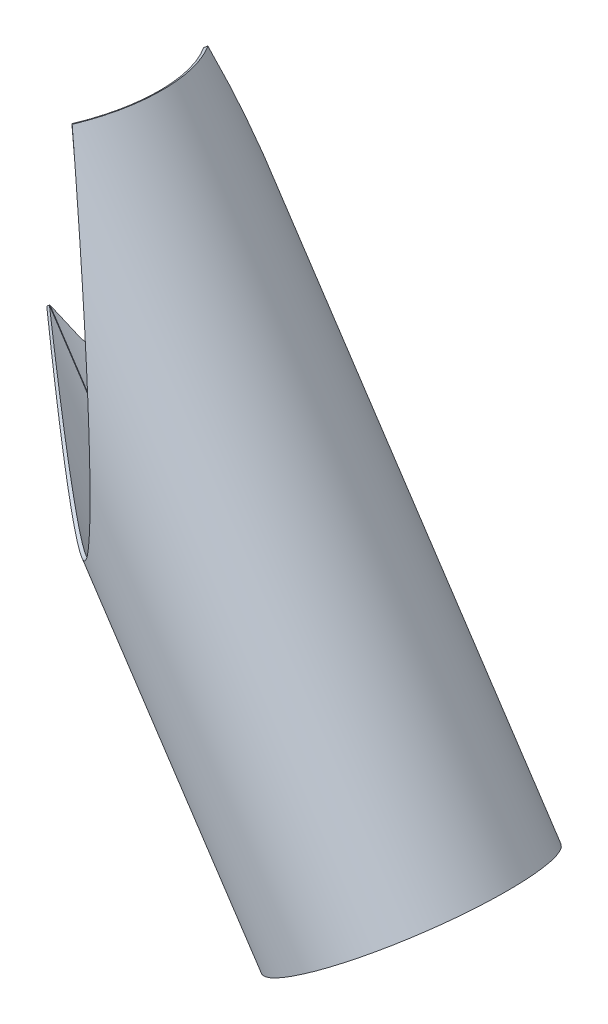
ISO-10303-21;
HEADER;
FILE_DESCRIPTION(('STEP AP214'),'2;1');
FILE_NAME('part.step','',(''),(''),'','','');
FILE_SCHEMA(('AUTOMOTIVE_DESIGN { 1 0 10303 214 1 1 1 1 }'));
ENDSEC;
DATA;
#1=APPLICATION_CONTEXT('core data for automotive mechanical design processes');
#2=APPLICATION_PROTOCOL_DEFINITION('international standard','automotive_design',2000,#1);
#3=PRODUCT_CONTEXT('',#1,'mechanical');
#4=PRODUCT('Part','Part','',(#3));
#5=PRODUCT_RELATED_PRODUCT_CATEGORY('part','',(#4));
#6=PRODUCT_DEFINITION_FORMATION('','',#4);
#7=PRODUCT_DEFINITION_CONTEXT('part definition',#1,'design');
#8=PRODUCT_DEFINITION('design','',#6,#7);
#9=PRODUCT_DEFINITION_SHAPE('','',#8);
#10=(LENGTH_UNIT() NAMED_UNIT(*) SI_UNIT(.MILLI.,.METRE.));
#11=(NAMED_UNIT(*) PLANE_ANGLE_UNIT() SI_UNIT($,.RADIAN.));
#12=(NAMED_UNIT(*) SI_UNIT($,.STERADIAN.) SOLID_ANGLE_UNIT());
#13=UNCERTAINTY_MEASURE_WITH_UNIT(LENGTH_MEASURE(1.E-05),#10,'distance_accuracy_value','');
#14=(GEOMETRIC_REPRESENTATION_CONTEXT(3) GLOBAL_UNCERTAINTY_ASSIGNED_CONTEXT((#13)) GLOBAL_UNIT_ASSIGNED_CONTEXT((#10,
#11,#12)) REPRESENTATION_CONTEXT('',''));
#15=CARTESIAN_POINT('',(0.,0.,0.));
#16=DIRECTION('',(0.,0.,1.));
#17=DIRECTION('',(1.,0.,0.));
#18=AXIS2_PLACEMENT_3D('',#15,#16,#17);
#19=CARTESIAN_POINT('',(0.688190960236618,-380.940704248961,-0.499999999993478));
#20=CARTESIAN_POINT('',(2.8912084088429,-384.254979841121,-2.10150110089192));
#21=CARTESIAN_POINT('',(5.03111841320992,-387.441205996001,-3.65577048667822));
#22=CARTESIAN_POINT('',(8.14239176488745,-392.031086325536,-5.91581853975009));
#23=CARTESIAN_POINT('',(9.15843581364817,-393.522740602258,-6.65399558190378));
#24=CARTESIAN_POINT('',(11.186329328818,-396.486042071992,-8.12734579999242));
#25=CARTESIAN_POINT('',(12.1975041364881,-397.956616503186,-8.8620080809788));
#26=CARTESIAN_POINT('',(17.2392653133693,-405.254275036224,-12.5250646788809));
#27=CARTESIAN_POINT('',(21.2271916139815,-410.915365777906,-15.4224759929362));
#28=CARTESIAN_POINT('',(29.1188592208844,-421.905692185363,-21.1561161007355));
#29=CARTESIAN_POINT('',(33.0190645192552,-427.230020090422,-23.9897168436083));
#30=CARTESIAN_POINT('',(40.7359339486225,-437.558873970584,-29.5964509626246));
#31=CARTESIAN_POINT('',(44.5564035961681,-442.568367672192,-32.3723514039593));
#32=CARTESIAN_POINT('',(55.8970395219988,-457.136611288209,-40.6120444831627));
#33=CARTESIAN_POINT('',(63.2964371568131,-466.235120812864,-45.9876366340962));
#34=CARTESIAN_POINT('',(77.7361812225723,-483.22937616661,-56.4785758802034));
#35=CARTESIAN_POINT('',(84.7981794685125,-491.151094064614,-61.6095524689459));
#36=CARTESIAN_POINT('',(105.503531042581,-513.261585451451,-76.6524308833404));
#37=CARTESIAN_POINT('',(118.720160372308,-525.852406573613,-86.2552532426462));
#38=CARTESIAN_POINT('',(137.576833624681,-541.642708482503,-99.955799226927));
#39=CARTESIAN_POINT('',(143.699744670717,-546.388979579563,-104.404119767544));
#40=CARTESIAN_POINT('',(155.597559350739,-554.862262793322,-113.048096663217));
#41=CARTESIAN_POINT('',(161.372316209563,-558.589542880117,-117.244066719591));
#42=CARTESIAN_POINT('',(172.592840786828,-565.066778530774,-125.39635862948));
#43=CARTESIAN_POINT('',(178.031029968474,-567.812199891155,-129.347037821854));
#44=CARTESIAN_POINT('',(188.563088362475,-572.336343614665,-136.999007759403));
#45=CARTESIAN_POINT('',(193.658952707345,-574.115600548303,-140.701604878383));
#46=CARTESIAN_POINT('',(208.409462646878,-578.022563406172,-151.41839714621));
#47=CARTESIAN_POINT('',(217.532482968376,-578.720025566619,-158.046837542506));
#48=CARTESIAN_POINT('',(234.269880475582,-576.392326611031,-170.206945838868));
#49=CARTESIAN_POINT('',(241.877223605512,-573.368960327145,-175.734077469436));
#50=CARTESIAN_POINT('',(255.505586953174,-563.671429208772,-185.635735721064));
#51=CARTESIAN_POINT('',(261.522997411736,-556.99932493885,-190.007521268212));
#52=CARTESIAN_POINT('',(271.874135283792,-540.040328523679,-197.52815093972));
#53=CARTESIAN_POINT('',(276.209539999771,-529.748487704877,-200.678292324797));
#54=CARTESIAN_POINT('',(281.362753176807,-511.605375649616,-204.422146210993));
#55=CARTESIAN_POINT('',(282.854258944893,-505.112425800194,-205.505573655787));
#56=CARTESIAN_POINT('',(285.371891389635,-491.215190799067,-207.334859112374));
#57=CARTESIAN_POINT('',(286.397777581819,-483.812548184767,-208.080221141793));
#58=CARTESIAN_POINT('',(287.963987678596,-468.112281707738,-209.218124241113));
#59=CARTESIAN_POINT('',(288.505118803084,-459.804201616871,-209.611467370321));
#60=CARTESIAN_POINT('',(289.083158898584,-442.276665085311,-210.031242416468));
#61=CARTESIAN_POINT('',(289.119966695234,-433.058936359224,-210.057905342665));
#62=CARTESIAN_POINT('',(288.664536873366,-413.676087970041,-209.727105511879));
#63=CARTESIAN_POINT('',(288.173015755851,-403.522712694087,-209.369880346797));
#64=CARTESIAN_POINT('',(286.630484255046,-382.239674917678,-208.249329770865));
#65=CARTESIAN_POINT('',(285.581132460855,-371.123327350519,-207.486710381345));
#66=CARTESIAN_POINT('',(282.88450803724,-347.871942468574,-205.527926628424));
#67=CARTESIAN_POINT('',(281.238340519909,-335.744704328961,-204.331876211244));
#68=CARTESIAN_POINT('',(278.297702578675,-316.817848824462,-202.195115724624));
#69=CARTESIAN_POINT('',(277.23967579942,-310.390735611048,-201.426401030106));
#70=CARTESIAN_POINT('',(274.955239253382,-297.254829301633,-199.766876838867));
#71=CARTESIAN_POINT('',(273.729394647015,-290.549560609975,-198.876380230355));
#72=CARTESIAN_POINT('',(271.105281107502,-276.867822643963,-196.969877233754));
#73=CARTESIAN_POINT('',(269.707012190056,-269.891353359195,-195.953869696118));
#74=CARTESIAN_POINT('',(266.732531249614,-255.670874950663,-193.792550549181));
#75=CARTESIAN_POINT('',(265.158221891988,-248.435275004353,-192.64869857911));
#76=CARTESIAN_POINT('',(260.13958642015,-226.244057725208,-189.002785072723));
#77=CARTESIAN_POINT('',(256.40248266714,-210.817094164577,-186.287548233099));
#78=CARTESIAN_POINT('',(251.204116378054,-190.767442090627,-182.51047488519));
#79=CARTESIAN_POINT('',(250.139009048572,-186.722710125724,-181.736617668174));
#80=CARTESIAN_POINT('',(247.948059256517,-178.531402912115,-180.144898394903));
#81=CARTESIAN_POINT('',(246.822660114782,-174.386573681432,-179.327333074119));
#82=CARTESIAN_POINT('',(243.354692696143,-161.805883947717,-176.807893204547));
#83=CARTESIAN_POINT('',(240.920385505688,-153.22380078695,-175.039255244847));
#84=CARTESIAN_POINT('',(237.076887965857,-140.063908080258,-172.246591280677));
#85=CARTESIAN_POINT('',(235.763708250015,-135.629487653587,-171.292423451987));
#86=CARTESIAN_POINT('',(233.071803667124,-126.666074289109,-169.336558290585));
#87=CARTESIAN_POINT('',(231.693132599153,-122.137084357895,-168.33493747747));
#88=CARTESIAN_POINT('',(227.429429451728,-108.323110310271,-165.237445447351));
#89=CARTESIAN_POINT('',(224.425513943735,-98.8401565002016,-163.055146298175));
#90=CARTESIAN_POINT('',(219.663350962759,-84.2146350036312,-159.59505043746));
#91=CARTESIAN_POINT('',(218.033232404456,-79.272623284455,-158.410584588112));
#92=CARTESIAN_POINT('',(214.684986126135,-69.2566138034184,-155.977772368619));
#93=CARTESIAN_POINT('',(212.971580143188,-64.1961382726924,-154.732891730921));
#94=CARTESIAN_POINT('',(207.63061127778,-48.632235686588,-150.852807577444));
#95=CARTESIAN_POINT('',(203.818015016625,-37.7934264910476,-148.083060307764));
#96=CARTESIAN_POINT('',(197.69209611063,-20.8602035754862,-143.631968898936));
#97=CARTESIAN_POINT('',(195.582241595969,-15.1033236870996,-142.09887219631));
#98=CARTESIAN_POINT('',(192.856700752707,-7.76886942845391,-140.118592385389));
#99=CARTESIAN_POINT('',(192.308199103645,-6.29775859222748,-139.720079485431));
#100=CARTESIAN_POINT('',(191.19080097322,-3.31121554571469,-138.908304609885));
#101=CARTESIAN_POINT('',(190.623119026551,-1.79905636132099,-138.495916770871));
#102=CARTESIAN_POINT('',(188.892795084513,2.79386563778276,-137.238971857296));
#103=CARTESIAN_POINT('',(187.702878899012,5.93107549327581,-136.374633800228));
#104=CARTESIAN_POINT('',(181.566839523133,21.9903668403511,-131.917301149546));
#105=CARTESIAN_POINT('',(176.062726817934,36.0329385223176,-127.917329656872));
#106=CARTESIAN_POINT('',(169.893568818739,51.2248383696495,-123.434902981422));
#107=CARTESIAN_POINT('',(5.68817678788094,-377.624088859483,-0.485714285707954));
#108=CARTESIAN_POINT('',(7.89110340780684,-380.938424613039,-2.04145818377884));
#109=CARTESIAN_POINT('',(10.0304895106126,-384.124998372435,-3.55131990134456));
#110=CARTESIAN_POINT('',(13.1404396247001,-388.715756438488,-5.74679515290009));
#111=CARTESIAN_POINT('',(14.1559560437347,-390.207760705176,-6.46388142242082));
#112=CARTESIAN_POINT('',(16.1826142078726,-393.171881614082,-7.89513591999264));
#113=CARTESIAN_POINT('',(17.1930805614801,-394.642925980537,-8.60880785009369));
#114=CARTESIAN_POINT('',(22.2308528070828,-401.943230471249,-12.1672056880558));
#115=CARTESIAN_POINT('',(26.2141603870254,-407.607384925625,-14.9818338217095));
#116=CARTESIAN_POINT('',(34.0938932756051,-418.605627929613,-20.5516556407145));
#117=CARTESIAN_POINT('',(37.9867881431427,-423.934805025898,-23.3042963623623));
#118=CARTESIAN_POINT('',(45.6864852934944,-434.275049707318,-28.7508380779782));
#119=CARTESIAN_POINT('',(49.497082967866,-439.291091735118,-31.4474270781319));
#120=CARTESIAN_POINT('',(60.8044419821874,-453.881408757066,-39.4517003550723));
#121=CARTESIAN_POINT('',(68.1767735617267,-462.997871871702,-44.6737041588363));
#122=CARTESIAN_POINT('',(82.5536797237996,-480.033809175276,-54.8649022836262));
#123=CARTESIAN_POINT('',(89.5798183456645,-487.979313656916,-59.8492795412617));
#124=CARTESIAN_POINT('',(110.165350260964,-510.169284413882,-74.4623614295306));
#125=CARTESIAN_POINT('',(123.285455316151,-522.824132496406,-83.7908174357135));
#126=CARTESIAN_POINT('',(141.975807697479,-538.724759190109,-97.0999192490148));
#127=CARTESIAN_POINT('',(148.039699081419,-543.510179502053,-101.421144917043));
#128=CARTESIAN_POINT('',(159.81296466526,-552.066079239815,-109.818151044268));
#129=CARTESIAN_POINT('',(165.522198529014,-555.836822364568,-113.894236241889));
#130=CARTESIAN_POINT('',(176.605341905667,-562.40518639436,-121.81360552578));
#131=CARTESIAN_POINT('',(181.971763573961,-565.198212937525,-125.651408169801));
#132=CARTESIAN_POINT('',(192.354395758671,-569.821474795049,-133.084750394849));
#133=CARTESIAN_POINT('',(197.372568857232,-571.652266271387,-136.681559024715));
#134=CARTESIAN_POINT('',(211.881830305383,-575.719255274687,-147.092157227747));
#135=CARTESIAN_POINT('',(220.833017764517,-576.530698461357,-153.53121361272));
#136=CARTESIAN_POINT('',(237.207688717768,-574.443605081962,-165.343890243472));
#137=CARTESIAN_POINT('',(244.624301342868,-571.546755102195,-170.713103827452));
#138=CARTESIAN_POINT('',(257.854629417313,-562.11325071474,-180.331857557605));
#139=CARTESIAN_POINT('',(263.664833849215,-555.578591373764,-184.578734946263));
#140=CARTESIAN_POINT('',(273.587391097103,-538.90388318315,-191.884489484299));
#141=CARTESIAN_POINT('',(277.701322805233,-528.758950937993,-194.944626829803));
#142=CARTESIAN_POINT('',(282.513504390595,-510.84205364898,-198.581513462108));
#143=CARTESIAN_POINT('',(283.88996171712,-504.425418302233,-199.63398583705));
#144=CARTESIAN_POINT('',(286.174736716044,-490.682643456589,-201.411005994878));
#145=CARTESIAN_POINT('',(287.08284029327,-483.358128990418,-202.135071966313));
#146=CARTESIAN_POINT('',(288.411340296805,-467.815541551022,-203.24046354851));
#147=CARTESIAN_POINT('',(288.832390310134,-459.587114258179,-203.622568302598));
#148=CARTESIAN_POINT('',(289.168277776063,-442.220203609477,-204.030349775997));
#149=CARTESIAN_POINT('',(289.083038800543,-433.083431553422,-204.056250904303));
#150=CARTESIAN_POINT('',(288.381543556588,-413.863804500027,-203.734902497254));
#151=CARTESIAN_POINT('',(287.766144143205,-403.792600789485,-203.38788376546));
#152=CARTESIAN_POINT('',(285.974107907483,-382.675065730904,-202.299348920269));
#153=CARTESIAN_POINT('',(284.799272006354,-371.641954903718,-201.558518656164));
#154=CARTESIAN_POINT('',(281.850135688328,-348.558067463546,-199.655700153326));
#155=CARTESIAN_POINT('',(280.077021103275,-336.515036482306,-198.493822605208));
#156=CARTESIAN_POINT('',(276.945628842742,-317.714713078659,-196.418112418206));
#157=CARTESIAN_POINT('',(275.824006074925,-311.329784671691,-195.671361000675));
#158=CARTESIAN_POINT('',(273.412011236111,-298.278490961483,-194.059251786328));
#159=CARTESIAN_POINT('',(272.122239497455,-291.615626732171,-193.194197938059));
#160=CARTESIAN_POINT('',(269.370123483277,-278.018796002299,-191.342166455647));
#161=CARTESIAN_POINT('',(267.907779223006,-271.084829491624,-190.3551877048));
#162=CARTESIAN_POINT('',(264.805157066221,-256.949350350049,-188.25562053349));
#163=CARTESIAN_POINT('',(263.166854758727,-249.756198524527,-187.144450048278));
#164=CARTESIAN_POINT('',(257.955732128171,-227.692662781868,-183.602705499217));
#165=CARTESIAN_POINT('',(254.089739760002,-212.351194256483,-180.965046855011));
#166=CARTESIAN_POINT('',(248.730637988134,-192.408162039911,-177.295889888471));
#167=CARTESIAN_POINT('',(247.633430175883,-188.384723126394,-176.544142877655));
#168=CARTESIAN_POINT('',(245.378144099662,-180.236091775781,-174.997901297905));
#169=CARTESIAN_POINT('',(244.220523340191,-176.112635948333,-174.203694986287));
#170=CARTESIAN_POINT('',(240.655787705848,-163.596134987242,-171.756239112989));
#171=CARTESIAN_POINT('',(238.156829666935,-155.056936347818,-170.038133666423));
#172=CARTESIAN_POINT('',(234.216391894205,-141.961346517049,-167.325260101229));
#173=CARTESIAN_POINT('',(232.870904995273,-137.548356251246,-166.398354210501));
#174=CARTESIAN_POINT('',(230.114441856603,-128.627766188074,-164.498370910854));
#175=CARTESIAN_POINT('',(228.703518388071,-124.12017007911,-163.525367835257));
#176=CARTESIAN_POINT('',(224.342603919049,-110.370678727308,-160.516375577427));
#177=CARTESIAN_POINT('',(221.273482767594,-100.930977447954,-158.396427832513));
#178=CARTESIAN_POINT('',(216.4133175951,-86.3704632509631,-155.035191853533));
#179=CARTESIAN_POINT('',(214.75049980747,-81.4501417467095,-153.884567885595));
#180=CARTESIAN_POINT('',(211.336864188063,-71.477506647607,-151.521264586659));
#181=CARTESIAN_POINT('',(209.590852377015,-66.438659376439,-150.31195196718));
#182=CARTESIAN_POINT('',(204.151015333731,-50.9403385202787,-146.542727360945));
#183=CARTESIAN_POINT('',(200.271413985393,-40.1459754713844,-143.852115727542));
#184=CARTESIAN_POINT('',(194.044179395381,-23.2799577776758,-139.528198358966));
#185=CARTESIAN_POINT('',(191.900419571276,-17.5455681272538,-138.038904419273));
#186=CARTESIAN_POINT('',(189.132426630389,-10.2392734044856,-136.11520403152));
#187=CARTESIAN_POINT('',(188.575446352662,-8.7737866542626,-135.728077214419));
#188=CARTESIAN_POINT('',(187.440912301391,-5.79861029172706,-134.939495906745));
#189=CARTESIAN_POINT('',(186.864592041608,-4.29218111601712,-134.538890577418));
#190=CARTESIAN_POINT('',(185.108151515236,0.283417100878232,-133.317858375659));
#191=CARTESIAN_POINT('',(183.900555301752,3.40889935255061,-132.47821569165));
#192=CARTESIAN_POINT('',(177.674903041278,19.4087482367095,-128.148235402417));
#193=CARTESIAN_POINT('',(172.095179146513,33.4011729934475,-124.262547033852));
#194=CARTESIAN_POINT('',(165.848483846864,48.5416325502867,-119.908191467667));
#195=B_SPLINE_SURFACE_WITH_KNOTS('',1,3,((#19,#20,#21,#22,#23,#24,#25,#26,#27,#28,#29,#30,#31,
#32,#33,#34,#35,#36,#37,#38,#39,#40,#41,#42,#43,#44,#45,#46,#47,#48,#49,#50,#51,#52,#53,#54,#55,
#56,#57,#58,#59,#60,#61,#62,#63,#64,#65,#66,#67,#68,#69,#70,#71,#72,#73,#74,#75,#76,#77,#78,#79,
#80,#81,#82,#83,#84,#85,#86,#87,#88,#89,#90,#91,#92,#93,#94,#95,#96,#97,#98,#99,#100,#101,#102,
#103,#104,#105,#106),(#107,#108,#109,#110,#111,#112,#113,#114,#115,#116,#117,#118,#119,#120,
#121,#122,#123,#124,#125,#126,#127,#128,#129,#130,#131,#132,#133,#134,#135,#136,#137,#138,#139,
#140,#141,#142,#143,#144,#145,#146,#147,#148,#149,#150,#151,#152,#153,#154,#155,#156,#157,#158,
#159,#160,#161,#162,#163,#164,#165,#166,#167,#168,#169,#170,#171,#172,#173,#174,#175,#176,#177,
#178,#179,#180,#181,#182,#183,#184,#185,#186,#187,#188,#189,#190,#191,#192,#193,#194)),
.UNSPECIFIED.,.F.,.F.,.F.,(2,2),(4,2,2,2,2,2,2,2,2,2,2,2,2,2,2,2,2,2,2,2,2,2,2,2,2,2,2,2,2,2,2,
2,2,2,2,2,2,2,2,2,2,2,2,4),(0.,1.),(0.,0.0078125,0.01171875,0.015625,0.03125,0.046875,0.0625,
0.09375,0.125,0.1875,0.21875,0.25,0.28125,0.3125,0.375,0.4375,0.5,0.5625,0.59375,0.625,0.65625,
0.6875,0.71875,0.75,0.78125,0.796875,0.8125,0.828125,0.84375,0.875,0.8828125,0.890625,0.90625,
0.9140625,0.921875,0.9375,0.9453125,0.953125,0.96875,0.9765625,0.978515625,0.98046875,0.984375,
1.),.UNSPECIFIED.);
#196=CARTESIAN_POINT('',(0.688190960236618,-380.940704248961,-0.499999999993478));
#197=CARTESIAN_POINT('',(5.68817678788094,-377.624088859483,-0.485714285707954));
#198=B_SPLINE_CURVE_WITH_KNOTS('',1,(#196,#197),.UNSPECIFIED.,.F.,.F.,(2,2),(0.,1.),.UNSPECIFIED.);
#199=CARTESIAN_POINT('',(5.68817678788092,-377.624088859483,-0.485714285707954));
#200=VERTEX_POINT('',#199);
#201=CARTESIAN_POINT('',(0.688190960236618,-380.940704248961,-0.499999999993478));
#202=VERTEX_POINT('',#201);
#203=EDGE_CURVE('E13',#200,#202,#198,.F.);
#204=CARTESIAN_POINT('',(5.68817678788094,-377.624088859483,-0.485714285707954));
#205=CARTESIAN_POINT('',(7.89110340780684,-380.938424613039,-2.04145818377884));
#206=CARTESIAN_POINT('',(10.0304895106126,-384.124998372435,-3.55131990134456));
#207=CARTESIAN_POINT('',(13.1404396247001,-388.715756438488,-5.74679515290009));
#208=CARTESIAN_POINT('',(14.1559560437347,-390.207760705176,-6.46388142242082));
#209=CARTESIAN_POINT('',(16.1826142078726,-393.171881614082,-7.89513591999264));
#210=CARTESIAN_POINT('',(17.1930805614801,-394.642925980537,-8.60880785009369));
#211=CARTESIAN_POINT('',(22.2308528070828,-401.943230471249,-12.1672056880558));
#212=CARTESIAN_POINT('',(26.2141603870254,-407.607384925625,-14.9818338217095));
#213=CARTESIAN_POINT('',(34.0938932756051,-418.605627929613,-20.5516556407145));
#214=CARTESIAN_POINT('',(37.9867881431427,-423.934805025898,-23.3042963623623));
#215=CARTESIAN_POINT('',(45.6864852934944,-434.275049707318,-28.7508380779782));
#216=CARTESIAN_POINT('',(49.497082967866,-439.291091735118,-31.4474270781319));
#217=CARTESIAN_POINT('',(60.8044419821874,-453.881408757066,-39.4517003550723));
#218=CARTESIAN_POINT('',(68.1767735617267,-462.997871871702,-44.6737041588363));
#219=CARTESIAN_POINT('',(82.5536797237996,-480.033809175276,-54.8649022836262));
#220=CARTESIAN_POINT('',(89.5798183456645,-487.979313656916,-59.8492795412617));
#221=CARTESIAN_POINT('',(110.165350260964,-510.169284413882,-74.4623614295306));
#222=CARTESIAN_POINT('',(123.285455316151,-522.824132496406,-83.7908174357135));
#223=CARTESIAN_POINT('',(141.975807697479,-538.724759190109,-97.0999192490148));
#224=CARTESIAN_POINT('',(148.039699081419,-543.510179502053,-101.421144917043));
#225=CARTESIAN_POINT('',(159.81296466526,-552.066079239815,-109.818151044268));
#226=CARTESIAN_POINT('',(165.522198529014,-555.836822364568,-113.894236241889));
#227=CARTESIAN_POINT('',(176.605341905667,-562.40518639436,-121.81360552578));
#228=CARTESIAN_POINT('',(181.971763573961,-565.198212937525,-125.651408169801));
#229=CARTESIAN_POINT('',(192.354395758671,-569.821474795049,-133.084750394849));
#230=CARTESIAN_POINT('',(197.372568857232,-571.652266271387,-136.681559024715));
#231=CARTESIAN_POINT('',(211.881830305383,-575.719255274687,-147.092157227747));
#232=CARTESIAN_POINT('',(220.833017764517,-576.530698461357,-153.53121361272));
#233=CARTESIAN_POINT('',(237.207688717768,-574.443605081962,-165.343890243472));
#234=CARTESIAN_POINT('',(244.624301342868,-571.546755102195,-170.713103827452));
#235=CARTESIAN_POINT('',(257.854629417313,-562.11325071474,-180.331857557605));
#236=CARTESIAN_POINT('',(263.664833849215,-555.578591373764,-184.578734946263));
#237=CARTESIAN_POINT('',(273.587391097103,-538.90388318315,-191.884489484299));
#238=CARTESIAN_POINT('',(277.701322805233,-528.758950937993,-194.944626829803));
#239=CARTESIAN_POINT('',(282.513504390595,-510.84205364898,-198.581513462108));
#240=CARTESIAN_POINT('',(283.88996171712,-504.425418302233,-199.63398583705));
#241=CARTESIAN_POINT('',(286.174736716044,-490.682643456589,-201.411005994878));
#242=CARTESIAN_POINT('',(287.08284029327,-483.358128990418,-202.135071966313));
#243=CARTESIAN_POINT('',(288.411340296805,-467.815541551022,-203.24046354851));
#244=CARTESIAN_POINT('',(288.832390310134,-459.587114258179,-203.622568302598));
#245=CARTESIAN_POINT('',(289.168277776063,-442.220203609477,-204.030349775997));
#246=CARTESIAN_POINT('',(289.083038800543,-433.083431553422,-204.056250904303));
#247=CARTESIAN_POINT('',(288.381543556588,-413.863804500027,-203.734902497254));
#248=CARTESIAN_POINT('',(287.766144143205,-403.792600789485,-203.38788376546));
#249=CARTESIAN_POINT('',(285.974107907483,-382.675065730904,-202.299348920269));
#250=CARTESIAN_POINT('',(284.799272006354,-371.641954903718,-201.558518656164));
#251=CARTESIAN_POINT('',(281.850135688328,-348.558067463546,-199.655700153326));
#252=CARTESIAN_POINT('',(280.077021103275,-336.515036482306,-198.493822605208));
#253=CARTESIAN_POINT('',(276.945628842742,-317.714713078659,-196.418112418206));
#254=CARTESIAN_POINT('',(275.824006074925,-311.329784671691,-195.671361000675));
#255=CARTESIAN_POINT('',(273.412011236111,-298.278490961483,-194.059251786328));
#256=CARTESIAN_POINT('',(272.122239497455,-291.615626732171,-193.194197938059));
#257=CARTESIAN_POINT('',(269.370123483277,-278.018796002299,-191.342166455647));
#258=CARTESIAN_POINT('',(267.907779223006,-271.084829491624,-190.3551877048));
#259=CARTESIAN_POINT('',(264.805157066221,-256.949350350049,-188.25562053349));
#260=CARTESIAN_POINT('',(263.166854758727,-249.756198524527,-187.144450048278));
#261=CARTESIAN_POINT('',(257.955732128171,-227.692662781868,-183.602705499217));
#262=CARTESIAN_POINT('',(254.089739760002,-212.351194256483,-180.965046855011));
#263=CARTESIAN_POINT('',(248.730637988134,-192.408162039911,-177.295889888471));
#264=CARTESIAN_POINT('',(247.633430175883,-188.384723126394,-176.544142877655));
#265=CARTESIAN_POINT('',(245.378144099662,-180.236091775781,-174.997901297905));
#266=CARTESIAN_POINT('',(244.220523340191,-176.112635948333,-174.203694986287));
#267=CARTESIAN_POINT('',(240.655787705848,-163.596134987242,-171.756239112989));
#268=CARTESIAN_POINT('',(238.156829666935,-155.056936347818,-170.038133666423));
#269=CARTESIAN_POINT('',(234.216391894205,-141.961346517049,-167.325260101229));
#270=CARTESIAN_POINT('',(232.870904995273,-137.548356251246,-166.398354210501));
#271=CARTESIAN_POINT('',(230.114441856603,-128.627766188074,-164.498370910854));
#272=CARTESIAN_POINT('',(228.703518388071,-124.12017007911,-163.525367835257));
#273=CARTESIAN_POINT('',(224.342603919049,-110.370678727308,-160.516375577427));
#274=CARTESIAN_POINT('',(221.273482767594,-100.930977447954,-158.396427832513));
#275=CARTESIAN_POINT('',(216.4133175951,-86.3704632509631,-155.035191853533));
#276=CARTESIAN_POINT('',(214.75049980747,-81.4501417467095,-153.884567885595));
#277=CARTESIAN_POINT('',(211.336864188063,-71.477506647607,-151.521264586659));
#278=CARTESIAN_POINT('',(209.590852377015,-66.438659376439,-150.31195196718));
#279=CARTESIAN_POINT('',(204.151015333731,-50.9403385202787,-146.542727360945));
#280=CARTESIAN_POINT('',(200.271413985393,-40.1459754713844,-143.852115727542));
#281=CARTESIAN_POINT('',(194.044179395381,-23.2799577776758,-139.528198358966));
#282=CARTESIAN_POINT('',(191.900419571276,-17.5455681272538,-138.038904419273));
#283=CARTESIAN_POINT('',(189.132426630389,-10.2392734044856,-136.11520403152));
#284=CARTESIAN_POINT('',(188.575446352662,-8.7737866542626,-135.728077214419));
#285=CARTESIAN_POINT('',(187.440912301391,-5.79861029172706,-134.939495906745));
#286=CARTESIAN_POINT('',(186.864592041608,-4.29218111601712,-134.538890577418));
#287=CARTESIAN_POINT('',(185.108151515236,0.283417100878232,-133.317858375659));
#288=CARTESIAN_POINT('',(183.900555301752,3.40889935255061,-132.47821569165));
#289=CARTESIAN_POINT('',(177.674903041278,19.4087482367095,-128.148235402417));
#290=CARTESIAN_POINT('',(172.095179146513,33.4011729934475,-124.262547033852));
#291=CARTESIAN_POINT('',(165.848483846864,48.5416325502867,-119.908191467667));
#292=B_SPLINE_CURVE_WITH_KNOTS('',3,(#204,#205,#206,#207,#208,#209,#210,#211,#212,#213,#214,
#215,#216,#217,#218,#219,#220,#221,#222,#223,#224,#225,#226,#227,#228,#229,#230,#231,#232,#233,
#234,#235,#236,#237,#238,#239,#240,#241,#242,#243,#244,#245,#246,#247,#248,#249,#250,#251,#252,
#253,#254,#255,#256,#257,#258,#259,#260,#261,#262,#263,#264,#265,#266,#267,#268,#269,#270,#271,
#272,#273,#274,#275,#276,#277,#278,#279,#280,#281,#282,#283,#284,#285,#286,#287,#288,#289,#290,
#291),.UNSPECIFIED.,.F.,.F.,(4,2,2,2,2,2,2,2,2,2,2,2,2,2,2,2,2,2,2,2,2,2,2,2,2,2,2,2,2,2,2,2,2,
2,2,2,2,2,2,2,2,2,2,4),(0.,0.0078125,0.01171875,0.015625,0.03125,0.046875,0.0625,0.09375,0.125,
0.1875,0.21875,0.25,0.28125,0.3125,0.375,0.4375,0.5,0.5625,0.59375,0.625,0.65625,0.6875,0.71875,
0.75,0.78125,0.796875,0.8125,0.828125,0.84375,0.875,0.8828125,0.890625,0.90625,0.9140625,
0.921875,0.9375,0.9453125,0.953125,0.96875,0.9765625,0.978515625,0.98046875,0.984375,1.),.UNSPECIFIED.);
#293=CARTESIAN_POINT('',(165.848483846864,48.5416325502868,-119.908191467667));
#294=VERTEX_POINT('',#293);
#295=EDGE_CURVE('E104',#200,#294,#292,.T.);
#296=CARTESIAN_POINT('',(165.848483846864,48.5416325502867,-119.908191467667));
#297=CARTESIAN_POINT('',(169.893568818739,51.2248383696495,-123.434902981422));
#298=B_SPLINE_CURVE_WITH_KNOTS('',1,(#296,#297),.UNSPECIFIED.,.F.,.F.,(2,2),(0.,1.),.UNSPECIFIED.);
#299=CARTESIAN_POINT('',(169.893568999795,51.2248379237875,-123.434903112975));
#300=VERTEX_POINT('',#299);
#301=EDGE_CURVE('E51',#294,#300,#298,.T.);
#302=CARTESIAN_POINT('',(169.893568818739,51.2248383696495,-123.434902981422));
#303=CARTESIAN_POINT('',(176.062726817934,36.0329385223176,-127.917329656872));
#304=CARTESIAN_POINT('',(181.566839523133,21.9903668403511,-131.917301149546));
#305=CARTESIAN_POINT('',(187.702878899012,5.93107549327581,-136.374633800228));
#306=CARTESIAN_POINT('',(188.892795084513,2.79386563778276,-137.238971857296));
#307=CARTESIAN_POINT('',(190.623119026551,-1.79905636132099,-138.495916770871));
#308=CARTESIAN_POINT('',(191.19080097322,-3.31121554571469,-138.908304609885));
#309=CARTESIAN_POINT('',(192.308199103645,-6.29775859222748,-139.720079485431));
#310=CARTESIAN_POINT('',(192.856700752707,-7.76886942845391,-140.118592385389));
#311=CARTESIAN_POINT('',(195.582241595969,-15.1033236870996,-142.09887219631));
#312=CARTESIAN_POINT('',(197.69209611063,-20.8602035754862,-143.631968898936));
#313=CARTESIAN_POINT('',(203.818015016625,-37.7934264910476,-148.083060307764));
#314=CARTESIAN_POINT('',(207.63061127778,-48.632235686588,-150.852807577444));
#315=CARTESIAN_POINT('',(212.971580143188,-64.1961382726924,-154.732891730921));
#316=CARTESIAN_POINT('',(214.684986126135,-69.2566138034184,-155.977772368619));
#317=CARTESIAN_POINT('',(218.033232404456,-79.272623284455,-158.410584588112));
#318=CARTESIAN_POINT('',(219.663350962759,-84.2146350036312,-159.59505043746));
#319=CARTESIAN_POINT('',(224.425513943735,-98.8401565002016,-163.055146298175));
#320=CARTESIAN_POINT('',(227.429429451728,-108.323110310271,-165.237445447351));
#321=CARTESIAN_POINT('',(231.693132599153,-122.137084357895,-168.33493747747));
#322=CARTESIAN_POINT('',(233.071803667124,-126.666074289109,-169.336558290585));
#323=CARTESIAN_POINT('',(235.763708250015,-135.629487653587,-171.292423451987));
#324=CARTESIAN_POINT('',(237.076887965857,-140.063908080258,-172.246591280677));
#325=CARTESIAN_POINT('',(240.920385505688,-153.22380078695,-175.039255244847));
#326=CARTESIAN_POINT('',(243.354692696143,-161.805883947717,-176.807893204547));
#327=CARTESIAN_POINT('',(246.822660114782,-174.386573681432,-179.327333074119));
#328=CARTESIAN_POINT('',(247.948059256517,-178.531402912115,-180.144898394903));
#329=CARTESIAN_POINT('',(250.139009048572,-186.722710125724,-181.736617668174));
#330=CARTESIAN_POINT('',(251.204116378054,-190.767442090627,-182.51047488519));
#331=CARTESIAN_POINT('',(256.40248266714,-210.817094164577,-186.287548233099));
#332=CARTESIAN_POINT('',(260.13958642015,-226.244057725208,-189.002785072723));
#333=CARTESIAN_POINT('',(265.158221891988,-248.435275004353,-192.64869857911));
#334=CARTESIAN_POINT('',(266.732531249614,-255.670874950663,-193.792550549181));
#335=CARTESIAN_POINT('',(269.707012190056,-269.891353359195,-195.953869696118));
#336=CARTESIAN_POINT('',(271.105281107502,-276.867822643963,-196.969877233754));
#337=CARTESIAN_POINT('',(273.729394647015,-290.549560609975,-198.876380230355));
#338=CARTESIAN_POINT('',(274.955239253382,-297.254829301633,-199.766876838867));
#339=CARTESIAN_POINT('',(277.23967579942,-310.390735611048,-201.426401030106));
#340=CARTESIAN_POINT('',(278.297702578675,-316.817848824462,-202.195115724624));
#341=CARTESIAN_POINT('',(281.238340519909,-335.744704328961,-204.331876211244));
#342=CARTESIAN_POINT('',(282.88450803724,-347.871942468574,-205.527926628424));
#343=CARTESIAN_POINT('',(285.581132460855,-371.123327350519,-207.486710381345));
#344=CARTESIAN_POINT('',(286.630484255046,-382.239674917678,-208.249329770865));
#345=CARTESIAN_POINT('',(288.173015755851,-403.522712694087,-209.369880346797));
#346=CARTESIAN_POINT('',(288.664536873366,-413.676087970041,-209.727105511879));
#347=CARTESIAN_POINT('',(289.119966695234,-433.058936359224,-210.057905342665));
#348=CARTESIAN_POINT('',(289.083158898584,-442.276665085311,-210.031242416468));
#349=CARTESIAN_POINT('',(288.505118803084,-459.804201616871,-209.611467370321));
#350=CARTESIAN_POINT('',(287.963987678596,-468.112281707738,-209.218124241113));
#351=CARTESIAN_POINT('',(286.397777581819,-483.812548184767,-208.080221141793));
#352=CARTESIAN_POINT('',(285.371891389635,-491.215190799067,-207.334859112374));
#353=CARTESIAN_POINT('',(282.854258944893,-505.112425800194,-205.505573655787));
#354=CARTESIAN_POINT('',(281.362753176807,-511.605375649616,-204.422146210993));
#355=CARTESIAN_POINT('',(276.209539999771,-529.748487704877,-200.678292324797));
#356=CARTESIAN_POINT('',(271.874135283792,-540.040328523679,-197.52815093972));
#357=CARTESIAN_POINT('',(261.522997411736,-556.99932493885,-190.007521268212));
#358=CARTESIAN_POINT('',(255.505586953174,-563.671429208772,-185.635735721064));
#359=CARTESIAN_POINT('',(241.877223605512,-573.368960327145,-175.734077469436));
#360=CARTESIAN_POINT('',(234.269880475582,-576.392326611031,-170.206945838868));
#361=CARTESIAN_POINT('',(217.532482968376,-578.720025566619,-158.046837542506));
#362=CARTESIAN_POINT('',(208.409462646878,-578.022563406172,-151.41839714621));
#363=CARTESIAN_POINT('',(193.658952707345,-574.115600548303,-140.701604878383));
#364=CARTESIAN_POINT('',(188.563088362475,-572.336343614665,-136.999007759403));
#365=CARTESIAN_POINT('',(178.031029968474,-567.812199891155,-129.347037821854));
#366=CARTESIAN_POINT('',(172.592840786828,-565.066778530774,-125.39635862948));
#367=CARTESIAN_POINT('',(161.372316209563,-558.589542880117,-117.244066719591));
#368=CARTESIAN_POINT('',(155.597559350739,-554.862262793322,-113.048096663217));
#369=CARTESIAN_POINT('',(143.699744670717,-546.388979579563,-104.404119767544));
#370=CARTESIAN_POINT('',(137.576833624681,-541.642708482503,-99.955799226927));
#371=CARTESIAN_POINT('',(118.720160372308,-525.852406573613,-86.2552532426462));
#372=CARTESIAN_POINT('',(105.503531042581,-513.261585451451,-76.6524308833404));
#373=CARTESIAN_POINT('',(84.7981794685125,-491.151094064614,-61.6095524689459));
#374=CARTESIAN_POINT('',(77.7361812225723,-483.22937616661,-56.4785758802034));
#375=CARTESIAN_POINT('',(63.2964371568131,-466.235120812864,-45.9876366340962));
#376=CARTESIAN_POINT('',(55.8970395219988,-457.136611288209,-40.6120444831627));
#377=CARTESIAN_POINT('',(44.5564035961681,-442.568367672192,-32.3723514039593));
#378=CARTESIAN_POINT('',(40.7359339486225,-437.558873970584,-29.5964509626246));
#379=CARTESIAN_POINT('',(33.0190645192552,-427.230020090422,-23.9897168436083));
#380=CARTESIAN_POINT('',(29.1188592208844,-421.905692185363,-21.1561161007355));
#381=CARTESIAN_POINT('',(21.2271916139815,-410.915365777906,-15.4224759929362));
#382=CARTESIAN_POINT('',(17.2392653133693,-405.254275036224,-12.5250646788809));
#383=CARTESIAN_POINT('',(12.1975041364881,-397.956616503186,-8.8620080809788));
#384=CARTESIAN_POINT('',(11.186329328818,-396.486042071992,-8.12734579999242));
#385=CARTESIAN_POINT('',(9.15843581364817,-393.522740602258,-6.65399558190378));
#386=CARTESIAN_POINT('',(8.14239176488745,-392.031086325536,-5.91581853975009));
#387=CARTESIAN_POINT('',(5.03111841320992,-387.441205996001,-3.65577048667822));
#388=CARTESIAN_POINT('',(2.8912084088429,-384.254979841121,-2.10150110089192));
#389=CARTESIAN_POINT('',(0.688190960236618,-380.940704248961,-0.499999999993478));
#390=B_SPLINE_CURVE_WITH_KNOTS('',3,(#302,#303,#304,#305,#306,#307,#308,#309,#310,#311,#312,
#313,#314,#315,#316,#317,#318,#319,#320,#321,#322,#323,#324,#325,#326,#327,#328,#329,#330,#331,
#332,#333,#334,#335,#336,#337,#338,#339,#340,#341,#342,#343,#344,#345,#346,#347,#348,#349,#350,
#351,#352,#353,#354,#355,#356,#357,#358,#359,#360,#361,#362,#363,#364,#365,#366,#367,#368,#369,
#370,#371,#372,#373,#374,#375,#376,#377,#378,#379,#380,#381,#382,#383,#384,#385,#386,#387,#388,
#389),.UNSPECIFIED.,.F.,.F.,(4,2,2,2,2,2,2,2,2,2,2,2,2,2,2,2,2,2,2,2,2,2,2,2,2,2,2,2,2,2,2,2,2,
2,2,2,2,2,2,2,2,2,2,4),(0.,0.015625,0.01953125,0.021484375,0.0234375,0.03125,0.046875,0.0546875,
0.0625,0.078125,0.0859375,0.09375,0.109375,0.1171875,0.125,0.15625,0.171875,0.1875,0.203125,
0.21875,0.25,0.28125,0.3125,0.34375,0.375,0.40625,0.4375,0.5,0.5625,0.625,0.6875,0.71875,0.75,
0.78125,0.8125,0.875,0.90625,0.9375,0.953125,0.96875,0.984375,0.98828125,0.9921875,1.),.UNSPECIFIED.);
#391=EDGE_CURVE('E102',#202,#300,#390,.F.);
#392=ORIENTED_EDGE('',*,*,#203,.F.);
#393=ORIENTED_EDGE('',*,*,#295,.T.);
#394=ORIENTED_EDGE('',*,*,#301,.T.);
#395=ORIENTED_EDGE('',*,*,#391,.F.);
#396=EDGE_LOOP('',(#392,#393,#394,#395));
#397=FACE_BOUND('',#396,.T.);
#398=ADVANCED_FACE('F40',(#397),#195,.T.);
#399=CARTESIAN_POINT('',(169.893568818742,51.2248383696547,123.434902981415));
#400=CARTESIAN_POINT('',(170.812905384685,51.5031277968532,122.168708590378));
#401=CARTESIAN_POINT('',(171.61416932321,51.7438906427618,121.03711443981));
#402=CARTESIAN_POINT('',(172.390752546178,51.9778247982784,119.922643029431));
#403=CARTESIAN_POINT('',(172.475303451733,52.0033031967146,119.801012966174));
#404=CARTESIAN_POINT('',(172.599543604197,52.040761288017,119.621883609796));
#405=CARTESIAN_POINT('',(172.649477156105,52.0558195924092,119.549810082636));
#406=CARTESIAN_POINT('',(172.747189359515,52.0852831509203,119.408572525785));
#407=CARTESIAN_POINT('',(172.795967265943,52.0999909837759,119.337974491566));
#408=CARTESIAN_POINT('',(173.039466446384,52.1734108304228,118.985088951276));
#409=CARTESIAN_POINT('',(173.233016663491,52.2317648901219,118.703115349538));
#410=CARTESIAN_POINT('',(173.617634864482,52.3477200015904,118.139860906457));
#411=CARTESIAN_POINT('',(173.80870284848,52.4053210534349,117.85858006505));
#412=CARTESIAN_POINT('',(174.188372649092,52.5197808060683,117.296733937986));
#413=CARTESIAN_POINT('',(174.374498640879,52.5758930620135,117.019870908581));
#414=CARTESIAN_POINT('',(175.323761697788,52.862089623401,115.600378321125));
#415=CARTESIAN_POINT('',(176.07134131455,53.0875018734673,114.458476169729));
#416=CARTESIAN_POINT('',(177.17486799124,53.4202387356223,112.736550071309));
#417=CARTESIAN_POINT('',(177.539736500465,53.5302541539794,112.161062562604));
#418=CARTESIAN_POINT('',(178.082567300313,53.6939244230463,111.295611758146));
#419=CARTESIAN_POINT('',(178.262765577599,53.7482557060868,111.006758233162));
#420=CARTESIAN_POINT('',(178.621669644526,53.8564661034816,110.428319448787));
#421=CARTESIAN_POINT('',(178.798584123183,53.9098051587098,110.141652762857));
#422=CARTESIAN_POINT('',(180.416333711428,54.3975375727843,107.505861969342));
#423=CARTESIAN_POINT('',(181.804227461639,54.8160408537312,105.141306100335));
#424=CARTESIAN_POINT('',(183.810560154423,55.4210092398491,101.565436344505));
#425=CARTESIAN_POINT('',(184.466754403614,55.6188685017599,100.368640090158));
#426=CARTESIAN_POINT('',(185.43213907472,55.9099410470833,98.5666091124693));
#427=CARTESIAN_POINT('',(185.750782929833,56.0060125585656,97.9647926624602));
#428=CARTESIAN_POINT('',(186.224018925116,56.1486886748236,97.0604114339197));
#429=CARTESIAN_POINT('',(186.380975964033,56.1960088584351,96.7586749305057));
#430=CARTESIAN_POINT('',(186.693312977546,56.2901718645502,96.154658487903));
#431=CARTESIAN_POINT('',(186.845664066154,56.3361015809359,95.8583063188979));
#432=CARTESIAN_POINT('',(189.525205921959,57.143892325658,90.6142303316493));
#433=CARTESIAN_POINT('',(191.839592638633,57.8419349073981,85.601938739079));
#434=CARTESIAN_POINT('',(194.99785073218,58.7943126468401,77.995649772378));
#435=CARTESIAN_POINT('',(195.998403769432,59.0960045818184,75.4455731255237));
#436=CARTESIAN_POINT('',(197.420863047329,59.5248445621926,71.6018322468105));
#437=CARTESIAN_POINT('',(197.881955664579,59.6638423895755,70.3174805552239));
#438=CARTESIAN_POINT('',(198.554006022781,59.8664173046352,68.3867100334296));
#439=CARTESIAN_POINT('',(198.774758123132,59.9329553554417,67.7424126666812));
#440=CARTESIAN_POINT('',(199.100990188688,60.0312826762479,66.7749573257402));
#441=CARTESIAN_POINT('',(199.208918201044,60.0638118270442,66.4523039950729));
#442=CARTESIAN_POINT('',(199.42314241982,60.1283770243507,65.8066694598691));
#443=CARTESIAN_POINT('',(199.527424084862,60.1598059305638,65.4898598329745));
#444=CARTESIAN_POINT('',(201.354838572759,60.7105501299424,59.8915482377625));
#445=CARTESIAN_POINT('',(202.861511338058,61.1649862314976,54.5676948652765));
#446=CARTESIAN_POINT('',(204.799739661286,61.7495059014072,46.5258630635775));
#447=CARTESIAN_POINT('',(205.392204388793,61.9281691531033,43.835908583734));
#448=CARTESIAN_POINT('',(206.20041220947,62.1718511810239,39.7902152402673));
#449=CARTESIAN_POINT('',(206.456401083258,62.2490271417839,38.4398569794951));
#450=CARTESIAN_POINT('',(206.820265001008,62.3587148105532,36.4120335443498));
#451=CARTESIAN_POINT('',(206.938199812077,62.3942647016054,35.7357113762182));
#452=CARTESIAN_POINT('',(207.167364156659,62.463339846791,34.3823722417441));
#453=CARTESIAN_POINT('',(207.277609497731,62.4965684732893,33.7115347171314));
#454=CARTESIAN_POINT('',(209.128261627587,63.054340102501,22.0918604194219));
#455=CARTESIAN_POINT('',(210.000000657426,63.3173813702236,11.0369783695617));
#456=CARTESIAN_POINT('',(209.999999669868,63.3173828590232,-5.51848918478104));
#457=CARTESIAN_POINT('',(209.782333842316,63.2518012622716,-11.0415550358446));
#458=CARTESIAN_POINT('',(209.12883467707,63.0547226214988,-19.3071918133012));
#459=CARTESIAN_POINT('',(208.856519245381,62.9725904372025,-22.059241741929));
#460=CARTESIAN_POINT('',(208.366419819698,62.8247977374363,-26.1793336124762));
#461=CARTESIAN_POINT('',(208.189450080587,62.7714351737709,-27.5513670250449));
#462=CARTESIAN_POINT('',(207.903612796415,62.6852585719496,-29.6070162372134));
#463=CARTESIAN_POINT('',(207.804936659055,62.655510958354,-30.291832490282));
#464=CARTESIAN_POINT('',(207.600794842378,62.5939745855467,-31.6605971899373));
#465=CARTESIAN_POINT('',(207.494340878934,62.5618879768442,-32.3507507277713));
#466=CARTESIAN_POINT('',(206.523514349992,62.269299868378,-38.4462320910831));
#467=CARTESIAN_POINT('',(205.44594129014,61.9444086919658,-43.8445994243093));
#468=CARTESIAN_POINT('',(203.507734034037,61.3599034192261,-51.8864375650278));
#469=CARTESIAN_POINT('',(202.808041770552,61.1488855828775,-54.5577606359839));
#470=CARTESIAN_POINT('',(201.67824345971,60.8082006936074,-58.5475359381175));
#471=CARTESIAN_POINT('',(201.288268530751,60.690613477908,-59.8745926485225));
#472=CARTESIAN_POINT('',(200.683275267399,60.5082157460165,-61.8604644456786));
#473=CARTESIAN_POINT('',(200.478272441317,60.4464137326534,-62.5216361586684));
#474=CARTESIAN_POINT('',(200.165765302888,60.3522096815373,-63.512163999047));
#475=CARTESIAN_POINT('',(200.060762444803,60.3205581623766,-63.8421349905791));
#476=CARTESIAN_POINT('',(199.849089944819,60.2567553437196,-64.5016584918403));
#477=CARTESIAN_POINT('',(199.740385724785,60.2239908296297,-64.8374440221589));
#478=CARTESIAN_POINT('',(197.947429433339,59.6836001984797,-70.3302453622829));
#479=CARTESIAN_POINT('',(196.050936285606,59.1118415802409,-75.4593992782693));
#480=CARTESIAN_POINT('',(192.892705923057,58.1594812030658,-83.0656995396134));
#481=CARTESIAN_POINT('',(191.787733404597,57.826253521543,-85.5865536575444));
#482=CARTESIAN_POINT('',(190.052112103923,57.3028707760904,-89.3425784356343));
#483=CARTESIAN_POINT('',(189.460545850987,57.1244871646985,-90.5903769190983));
#484=CARTESIAN_POINT('',(188.553691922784,56.8510503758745,-92.4553334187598));
#485=CARTESIAN_POINT('',(188.248156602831,56.7589279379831,-93.0758620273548));
#486=CARTESIAN_POINT('',(187.784982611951,56.6192823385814,-94.0049161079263));
#487=CARTESIAN_POINT('',(187.629779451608,56.5724901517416,-94.3143109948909));
#488=CARTESIAN_POINT('',(187.317750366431,56.4784190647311,-94.9325122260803));
#489=CARTESIAN_POINT('',(187.157895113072,56.4302269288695,-95.2472472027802));
#490=CARTESIAN_POINT('',(185.766427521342,56.010748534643,-97.9704579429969));
#491=CARTESIAN_POINT('',(184.479137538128,55.6226030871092,-100.373849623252));
#492=CARTESIAN_POINT('',(182.472798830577,55.0176312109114,-103.949714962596));
#493=CARTESIAN_POINT('',(181.791453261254,54.8121824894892,-105.136799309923));
#494=CARTESIAN_POINT('',(180.750627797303,54.4983500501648,-106.909696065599));
#495=CARTESIAN_POINT('',(180.400551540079,54.3927960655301,-107.499373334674));
#496=CARTESIAN_POINT('',(179.694138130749,54.179807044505,-108.676080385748));
#497=CARTESIAN_POINT('',(179.334389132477,54.0713433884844,-109.26866905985));
#498=CARTESIAN_POINT('',(178.266234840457,53.7493111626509,-111.009003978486));
#499=CARTESIAN_POINT('',(177.542303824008,53.531030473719,-112.163216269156));
#500=CARTESIAN_POINT('',(176.438770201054,53.1982903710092,-113.885140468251));
#501=CARTESIAN_POINT('',(176.067986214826,53.0864905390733,-114.457549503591));
#502=CARTESIAN_POINT('',(175.320557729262,52.8611301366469,-115.599173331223));
#503=CARTESIAN_POINT('',(174.941500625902,52.7468421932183,-116.171995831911));
#504=CARTESIAN_POINT('',(174.187195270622,52.5194276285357,-117.299952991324));
#505=CARTESIAN_POINT('',(173.806450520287,52.4046400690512,-117.863385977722));
#506=CARTESIAN_POINT('',(173.229921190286,52.2308223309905,-118.70763943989));
#507=CARTESIAN_POINT('',(173.036842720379,52.1726103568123,-118.988907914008));
#508=CARTESIAN_POINT('',(172.794364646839,52.099502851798,-119.34029865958));
#509=CARTESIAN_POINT('',(172.743275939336,52.0840985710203,-119.414229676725));
#510=CARTESIAN_POINT('',(172.658926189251,52.058669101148,-119.536154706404));
#511=CARTESIAN_POINT('',(172.616387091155,52.0458474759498,-119.59757238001));
#512=CARTESIAN_POINT('',(172.487673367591,52.0070594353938,-119.783187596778));
#513=CARTESIAN_POINT('',(172.400402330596,51.9807698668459,-119.90874735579));
#514=CARTESIAN_POINT('',(171.601713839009,51.7402247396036,-121.055050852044));
#515=CARTESIAN_POINT('',(170.797650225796,51.4984589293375,-122.189758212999));
#516=CARTESIAN_POINT('',(169.893568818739,51.2248383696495,-123.434902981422));
#517=CARTESIAN_POINT('',(165.848483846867,48.5416325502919,119.90819146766));
#518=CARTESIAN_POINT('',(166.745916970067,48.8053928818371,118.67817407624));
#519=CARTESIAN_POINT('',(167.528114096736,49.0335082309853,117.578911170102));
#520=CARTESIAN_POINT('',(168.286210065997,49.2551793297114,116.496281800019));
#521=CARTESIAN_POINT('',(168.368748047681,49.2793225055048,116.378126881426));
#522=CARTESIAN_POINT('',(168.490030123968,49.3148184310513,116.204115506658));
#523=CARTESIAN_POINT('',(168.5387747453,49.329088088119,116.134101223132));
#524=CARTESIAN_POINT('',(168.634160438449,49.3570084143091,115.996899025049));
#525=CARTESIAN_POINT('',(168.681776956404,49.3709458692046,115.928318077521));
#526=CARTESIAN_POINT('',(168.919478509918,49.4405200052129,115.585514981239));
#527=CARTESIAN_POINT('',(169.108420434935,49.495817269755,115.311597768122));
#528=CARTESIAN_POINT('',(169.483881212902,49.6056980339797,114.764436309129));
#529=CARTESIAN_POINT('',(169.670400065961,49.6602815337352,114.491192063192));
#530=CARTESIAN_POINT('',(170.041030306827,49.7687451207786,113.945398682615));
#531=CARTESIAN_POINT('',(170.222724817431,49.8219178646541,113.676446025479));
#532=CARTESIAN_POINT('',(171.149386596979,50.0931224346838,112.297510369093));
#533=CARTESIAN_POINT('',(171.879166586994,50.306727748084,111.188233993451));
#534=CARTESIAN_POINT('',(172.956418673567,50.6220360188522,109.515505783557));
#535=CARTESIAN_POINT('',(173.312599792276,50.7262888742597,108.956460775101));
#536=CARTESIAN_POINT('',(173.84250604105,50.8813859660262,108.115737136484));
#537=CARTESIAN_POINT('',(174.018413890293,50.9328713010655,107.835136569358));
#538=CARTESIAN_POINT('',(174.368772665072,51.0354133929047,107.273224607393));
#539=CARTESIAN_POINT('',(174.54147492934,51.0859583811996,106.994748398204));
#540=CARTESIAN_POINT('',(176.120707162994,51.5481412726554,104.434265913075));
#541=CARTESIAN_POINT('',(177.475555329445,51.9447245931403,102.137268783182));
#542=CARTESIAN_POINT('',(179.434117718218,52.5180057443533,98.6635667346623));
#543=CARTESIAN_POINT('',(180.074688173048,52.7055013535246,97.5009646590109));
#544=CARTESIAN_POINT('',(181.01708751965,52.9813271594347,95.7504202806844));
#545=CARTESIAN_POINT('',(181.328144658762,53.072366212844,95.1657985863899));
#546=CARTESIAN_POINT('',(181.790113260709,53.20756838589,94.2872568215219));
#547=CARTESIAN_POINT('',(181.943333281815,53.2524097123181,93.9941413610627));
#548=CARTESIAN_POINT('',(182.248233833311,53.3416399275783,93.4073825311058));
#549=CARTESIAN_POINT('',(182.396957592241,53.385163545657,93.1194975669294));
#550=CARTESIAN_POINT('',(185.012702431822,54.1506361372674,88.0252523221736));
#551=CARTESIAN_POINT('',(187.271981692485,54.8121245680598,83.1561690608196));
#552=CARTESIAN_POINT('',(190.355041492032,55.7146214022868,75.7672026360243));
#553=CARTESIAN_POINT('',(191.331771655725,56.0005110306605,73.2899853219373));
#554=CARTESIAN_POINT('',(192.720363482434,56.4068858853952,69.5560656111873));
#555=CARTESIAN_POINT('',(193.170478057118,56.538601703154,68.3084096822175));
#556=CARTESIAN_POINT('',(193.826527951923,56.7305631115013,66.4328040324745));
#557=CARTESIAN_POINT('',(194.042024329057,56.7936149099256,65.8069151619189));
#558=CARTESIAN_POINT('',(194.360489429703,56.886790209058,64.8671014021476));
#559=CARTESIAN_POINT('',(194.465847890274,56.9176149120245,64.5536667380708));
#560=CARTESIAN_POINT('',(194.674971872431,56.9787969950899,63.9264789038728));
#561=CARTESIAN_POINT('',(194.776770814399,57.0085790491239,63.6187209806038));
#562=CARTESIAN_POINT('',(196.560678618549,57.5304641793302,58.180361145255));
#563=CARTESIAN_POINT('',(198.031476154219,57.9611033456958,53.0086178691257));
#564=CARTESIAN_POINT('',(199.923554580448,58.5150106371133,45.1965526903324));
#565=CARTESIAN_POINT('',(200.501912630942,58.6843165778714,42.5834540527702));
#566=CARTESIAN_POINT('',(201.290877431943,58.9152342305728,38.6533519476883));
#567=CARTESIAN_POINT('',(201.540771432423,58.9883673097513,37.3415753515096));
#568=CARTESIAN_POINT('',(201.895972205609,59.0923084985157,35.371689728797));
#569=CARTESIAN_POINT('',(202.011099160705,59.1259958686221,34.7146910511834));
#570=CARTESIAN_POINT('',(202.234807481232,59.1914518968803,33.4000187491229));
#571=CARTESIAN_POINT('',(202.342428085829,59.2229394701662,32.7483480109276));
#572=CARTESIAN_POINT('',(204.149019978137,59.7514848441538,21.4606644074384));
#573=CARTESIAN_POINT('',(205.000000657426,60.0007565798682,10.7216361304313));
#574=CARTESIAN_POINT('',(204.999999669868,60.0007580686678,-5.36081806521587));
#575=CARTESIAN_POINT('',(204.787515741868,59.9386137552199,-10.7260820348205));
#576=CARTESIAN_POINT('',(204.149576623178,59.7518564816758,-18.7555577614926));
#577=CARTESIAN_POINT('',(203.883745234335,59.6740253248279,-21.4289776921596));
#578=CARTESIAN_POINT('',(203.405315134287,59.5339731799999,-25.4313526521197));
#579=CARTESIAN_POINT('',(203.232559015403,59.4834056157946,-26.7641851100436));
#580=CARTESIAN_POINT('',(202.953527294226,59.4017433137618,-28.7611014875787));
#581=CARTESIAN_POINT('',(202.857200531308,59.3735540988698,-29.4263515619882));
#582=CARTESIAN_POINT('',(202.657919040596,59.3152417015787,-30.7560086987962));
#583=CARTESIAN_POINT('',(202.553999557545,59.2848362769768,-31.4264435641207));
#584=CARTESIAN_POINT('',(201.606286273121,59.0075797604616,-37.3477683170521));
#585=CARTESIAN_POINT('',(200.554369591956,58.6997071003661,-42.5918965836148));
#586=CARTESIAN_POINT('',(198.66231162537,58.14581380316,-50.4039679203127));
#587=CARTESIAN_POINT('',(197.97927939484,57.9458469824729,-52.9989674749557));
#588=CARTESIAN_POINT('',(196.876381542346,57.6230058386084,-56.8747491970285));
#589=CARTESIAN_POINT('',(196.495691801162,57.5115777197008,-58.1638900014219));
#590=CARTESIAN_POINT('',(195.905102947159,57.3387347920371,-60.0930226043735));
#591=CARTESIAN_POINT('',(195.704981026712,57.2801704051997,-60.7353036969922));
#592=CARTESIAN_POINT('',(195.399914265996,57.1909017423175,-61.6975307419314));
#593=CARTESIAN_POINT('',(195.297411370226,57.1609085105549,-62.0180739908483));
#594=CARTESIAN_POINT('',(195.090778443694,57.1004485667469,-62.658753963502));
#595=CARTESIAN_POINT('',(194.984662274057,57.0694007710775,-62.9849456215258));
#596=CARTESIAN_POINT('',(193.234392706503,56.5573253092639,-68.3208097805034));
#597=CARTESIAN_POINT('',(191.383053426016,56.0155183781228,-73.3034164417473));
#598=CARTESIAN_POINT('',(188.300020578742,55.1130383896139,-80.6923938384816));
#599=CARTESIAN_POINT('',(187.22135779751,54.7972626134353,-83.1412235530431));
#600=CARTESIAN_POINT('',(185.527061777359,54.3012919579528,-86.7899333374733));
#601=CARTESIAN_POINT('',(184.949580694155,54.1322513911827,-88.0020804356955));
#602=CARTESIAN_POINT('',(184.064318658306,53.8731370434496,-89.813752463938));
#603=CARTESIAN_POINT('',(183.766057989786,53.7858400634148,-90.4165516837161));
#604=CARTESIAN_POINT('',(183.313911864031,53.6535095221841,-91.3190613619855));
#605=CARTESIAN_POINT('',(183.162403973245,53.6091684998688,-91.6196163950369));
#606=CARTESIAN_POINT('',(182.857804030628,53.5200253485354,-92.2201547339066));
#607=CARTESIAN_POINT('',(182.701754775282,53.4743578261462,-92.5258972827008));
#608=CARTESIAN_POINT('',(181.343416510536,53.0768549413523,-95.1713020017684));
#609=CARTESIAN_POINT('',(180.086776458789,52.7090403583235,-97.5060253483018));
#610=CARTESIAN_POINT('',(178.128208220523,52.1357558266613,-100.979723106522));
#611=CARTESIAN_POINT('',(177.463085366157,51.9410680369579,-102.132890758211));
#612=CARTESIAN_POINT('',(176.447041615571,51.6436739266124,-103.855133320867));
#613=CARTESIAN_POINT('',(176.105300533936,51.5436488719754,-104.427962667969));
#614=CARTESIAN_POINT('',(175.415706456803,51.3418165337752,-105.571049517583));
#615=CARTESIAN_POINT('',(175.06452284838,51.2390345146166,-106.146707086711));
#616=CARTESIAN_POINT('',(174.021800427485,50.933871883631,-107.837318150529));
#617=CARTESIAN_POINT('',(173.315105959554,50.7270246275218,-108.95855294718));
#618=CARTESIAN_POINT('',(172.237847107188,50.4117132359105,-110.631279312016));
#619=CARTESIAN_POINT('',(171.875891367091,50.3057693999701,-111.187333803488));
#620=CARTESIAN_POINT('',(171.146258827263,50.0922134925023,-112.296339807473));
#621=CARTESIAN_POINT('',(170.776226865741,49.9839121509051,-112.852795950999));
#622=CARTESIAN_POINT('',(170.039880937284,49.7684105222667,-113.948525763));
#623=CARTESIAN_POINT('',(169.668201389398,49.6596361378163,-114.495860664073));
#624=CARTESIAN_POINT('',(169.105398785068,49.4949236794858,-115.31599259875));
#625=CARTESIAN_POINT('',(168.916917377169,49.4397610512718,-115.589224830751));
#626=CARTESIAN_POINT('',(168.680212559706,49.3704830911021,-115.930575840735));
#627=CARTESIAN_POINT('',(168.630340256,49.3558856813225,-116.002394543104));
#628=CARTESIAN_POINT('',(168.547998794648,49.3317883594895,-116.120836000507));
#629=CARTESIAN_POINT('',(168.506472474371,49.3196385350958,-116.180498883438));
#630=CARTESIAN_POINT('',(168.380823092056,49.2828831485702,-116.360810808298));
#631=CARTESIAN_POINT('',(168.295629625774,49.2579716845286,-116.482783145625));
#632=CARTESIAN_POINT('',(167.515953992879,49.0300382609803,-117.596335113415));
#633=CARTESIAN_POINT('',(166.731025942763,48.8009655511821,-118.698622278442));
#634=CARTESIAN_POINT('',(165.848483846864,48.5416325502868,-119.908191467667));
#635=B_SPLINE_SURFACE_WITH_KNOTS('',1,3,((#399,#400,#401,#402,#403,#404,#405,#406,#407,#408,
#409,#410,#411,#412,#413,#414,#415,#416,#417,#418,#419,#420,#421,#422,#423,#424,#425,#426,#427,
#428,#429,#430,#431,#432,#433,#434,#435,#436,#437,#438,#439,#440,#441,#442,#443,#444,#445,#446,
#447,#448,#449,#450,#451,#452,#453,#454,#455,#456,#457,#458,#459,#460,#461,#462,#463,#464,#465,
#466,#467,#468,#469,#470,#471,#472,#473,#474,#475,#476,#477,#478,#479,#480,#481,#482,#483,#484,
#485,#486,#487,#488,#489,#490,#491,#492,#493,#494,#495,#496,#497,#498,#499,#500,#501,#502,#503,
#504,#505,#506,#507,#508,#509,#510,#511,#512,#513,#514,#515,#516),(#517,#518,#519,#520,#521,
#522,#523,#524,#525,#526,#527,#528,#529,#530,#531,#532,#533,#534,#535,#536,#537,#538,#539,#540,
#541,#542,#543,#544,#545,#546,#547,#548,#549,#550,#551,#552,#553,#554,#555,#556,#557,#558,#559,
#560,#561,#562,#563,#564,#565,#566,#567,#568,#569,#570,#571,#572,#573,#574,#575,#576,#577,#578,
#579,#580,#581,#582,#583,#584,#585,#586,#587,#588,#589,#590,#591,#592,#593,#594,#595,#596,#597,
#598,#599,#600,#601,#602,#603,#604,#605,#606,#607,#608,#609,#610,#611,#612,#613,#614,#615,#616,
#617,#618,#619,#620,#621,#622,#623,#624,#625,#626,#627,#628,#629,#630,#631,#632,#633,#634)),
.UNSPECIFIED.,.F.,.F.,.F.,(2,2),(4,2,2,2,2,2,2,2,2,2,2,2,2,2,2,2,2,2,2,2,2,2,2,2,2,2,2,2,2,2,2,
2,2,2,2,2,2,2,2,2,2,2,2,2,2,2,2,2,2,2,2,2,2,2,2,2,2,2,4),(0.,1.),(0.,0.015625,0.017578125,
0.0185546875,0.01953125,0.0234375,0.02734375,0.03125,0.046875,0.0546875,0.05859375,0.0625,
0.09375,0.109375,0.1171875,0.12109375,0.125,0.1875,0.21875,0.234375,0.2421875,0.24609375,0.25,
0.3125,0.34375,0.359375,0.3671875,0.375,0.5,0.5625,0.59375,0.609375,0.6171875,0.625,0.6875,
0.71875,0.734375,0.7421875,0.74609375,0.75,0.8125,0.84375,0.859375,0.8671875,0.87109375,0.875,
0.90625,0.921875,0.9296875,0.9375,0.953125,0.9609375,0.96875,0.9765625,0.98046875,0.9814453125,
0.982421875,0.984375,1.),.UNSPECIFIED.);
#636=CARTESIAN_POINT('',(165.848483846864,48.5416325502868,-119.908191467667));
#637=CARTESIAN_POINT('',(166.731025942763,48.8009655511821,-118.698622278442));
#638=CARTESIAN_POINT('',(167.515953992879,49.0300382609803,-117.596335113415));
#639=CARTESIAN_POINT('',(168.295629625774,49.2579716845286,-116.482783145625));
#640=CARTESIAN_POINT('',(168.380823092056,49.2828831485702,-116.360810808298));
#641=CARTESIAN_POINT('',(168.506472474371,49.3196385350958,-116.180498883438));
#642=CARTESIAN_POINT('',(168.547998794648,49.3317883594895,-116.120836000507));
#643=CARTESIAN_POINT('',(168.630340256,49.3558856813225,-116.002394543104));
#644=CARTESIAN_POINT('',(168.680212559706,49.3704830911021,-115.930575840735));
#645=CARTESIAN_POINT('',(168.916917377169,49.4397610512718,-115.589224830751));
#646=CARTESIAN_POINT('',(169.105398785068,49.4949236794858,-115.31599259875));
#647=CARTESIAN_POINT('',(169.668201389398,49.6596361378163,-114.495860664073));
#648=CARTESIAN_POINT('',(170.039880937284,49.7684105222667,-113.948525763));
#649=CARTESIAN_POINT('',(170.776226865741,49.9839121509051,-112.852795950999));
#650=CARTESIAN_POINT('',(171.146258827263,50.0922134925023,-112.296339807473));
#651=CARTESIAN_POINT('',(171.875891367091,50.3057693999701,-111.187333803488));
#652=CARTESIAN_POINT('',(172.237847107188,50.4117132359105,-110.631279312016));
#653=CARTESIAN_POINT('',(173.315105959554,50.7270246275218,-108.95855294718));
#654=CARTESIAN_POINT('',(174.021800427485,50.933871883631,-107.837318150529));
#655=CARTESIAN_POINT('',(175.06452284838,51.2390345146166,-106.146707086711));
#656=CARTESIAN_POINT('',(175.415706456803,51.3418165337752,-105.571049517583));
#657=CARTESIAN_POINT('',(176.105300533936,51.5436488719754,-104.427962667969));
#658=CARTESIAN_POINT('',(176.447041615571,51.6436739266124,-103.855133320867));
#659=CARTESIAN_POINT('',(177.463085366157,51.9410680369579,-102.132890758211));
#660=CARTESIAN_POINT('',(178.128208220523,52.1357558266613,-100.979723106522));
#661=CARTESIAN_POINT('',(180.086776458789,52.7090403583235,-97.5060253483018));
#662=CARTESIAN_POINT('',(181.343416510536,53.0768549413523,-95.1713020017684));
#663=CARTESIAN_POINT('',(182.701754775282,53.4743578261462,-92.5258972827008));
#664=CARTESIAN_POINT('',(182.857804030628,53.5200253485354,-92.2201547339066));
#665=CARTESIAN_POINT('',(183.162403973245,53.6091684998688,-91.6196163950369));
#666=CARTESIAN_POINT('',(183.313911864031,53.6535095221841,-91.3190613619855));
#667=CARTESIAN_POINT('',(183.766057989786,53.7858400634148,-90.4165516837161));
#668=CARTESIAN_POINT('',(184.064318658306,53.8731370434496,-89.813752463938));
#669=CARTESIAN_POINT('',(184.949580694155,54.1322513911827,-88.0020804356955));
#670=CARTESIAN_POINT('',(185.527061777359,54.3012919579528,-86.7899333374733));
#671=CARTESIAN_POINT('',(187.22135779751,54.7972626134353,-83.1412235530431));
#672=CARTESIAN_POINT('',(188.300020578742,55.1130383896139,-80.6923938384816));
#673=CARTESIAN_POINT('',(191.383053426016,56.0155183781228,-73.3034164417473));
#674=CARTESIAN_POINT('',(193.234392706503,56.5573253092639,-68.3208097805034));
#675=CARTESIAN_POINT('',(194.984662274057,57.0694007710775,-62.9849456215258));
#676=CARTESIAN_POINT('',(195.090778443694,57.1004485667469,-62.658753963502));
#677=CARTESIAN_POINT('',(195.297411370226,57.1609085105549,-62.0180739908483));
#678=CARTESIAN_POINT('',(195.399914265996,57.1909017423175,-61.6975307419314));
#679=CARTESIAN_POINT('',(195.704981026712,57.2801704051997,-60.7353036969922));
#680=CARTESIAN_POINT('',(195.905102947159,57.3387347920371,-60.0930226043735));
#681=CARTESIAN_POINT('',(196.495691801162,57.5115777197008,-58.1638900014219));
#682=CARTESIAN_POINT('',(196.876381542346,57.6230058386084,-56.8747491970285));
#683=CARTESIAN_POINT('',(197.97927939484,57.9458469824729,-52.9989674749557));
#684=CARTESIAN_POINT('',(198.66231162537,58.14581380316,-50.4039679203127));
#685=CARTESIAN_POINT('',(200.554369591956,58.6997071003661,-42.5918965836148));
#686=CARTESIAN_POINT('',(201.606286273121,59.0075797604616,-37.3477683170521));
#687=CARTESIAN_POINT('',(202.553999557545,59.2848362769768,-31.4264435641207));
#688=CARTESIAN_POINT('',(202.657919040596,59.3152417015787,-30.7560086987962));
#689=CARTESIAN_POINT('',(202.857200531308,59.3735540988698,-29.4263515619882));
#690=CARTESIAN_POINT('',(202.953527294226,59.4017433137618,-28.7611014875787));
#691=CARTESIAN_POINT('',(203.232559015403,59.4834056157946,-26.7641851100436));
#692=CARTESIAN_POINT('',(203.405315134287,59.5339731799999,-25.4313526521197));
#693=CARTESIAN_POINT('',(203.883745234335,59.6740253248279,-21.4289776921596));
#694=CARTESIAN_POINT('',(204.149576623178,59.7518564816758,-18.7555577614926));
#695=CARTESIAN_POINT('',(204.787515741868,59.9386137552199,-10.7260820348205));
#696=CARTESIAN_POINT('',(204.999999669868,60.0007580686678,-5.36081806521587));
#697=CARTESIAN_POINT('',(205.000000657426,60.0007565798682,10.7216361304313));
#698=CARTESIAN_POINT('',(204.149019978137,59.7514848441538,21.4606644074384));
#699=CARTESIAN_POINT('',(202.342428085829,59.2229394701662,32.7483480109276));
#700=CARTESIAN_POINT('',(202.234807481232,59.1914518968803,33.4000187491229));
#701=CARTESIAN_POINT('',(202.011099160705,59.1259958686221,34.7146910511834));
#702=CARTESIAN_POINT('',(201.895972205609,59.0923084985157,35.371689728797));
#703=CARTESIAN_POINT('',(201.540771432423,58.9883673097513,37.3415753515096));
#704=CARTESIAN_POINT('',(201.290877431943,58.9152342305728,38.6533519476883));
#705=CARTESIAN_POINT('',(200.501912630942,58.6843165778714,42.5834540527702));
#706=CARTESIAN_POINT('',(199.923554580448,58.5150106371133,45.1965526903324));
#707=CARTESIAN_POINT('',(198.031476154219,57.9611033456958,53.0086178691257));
#708=CARTESIAN_POINT('',(196.560678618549,57.5304641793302,58.180361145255));
#709=CARTESIAN_POINT('',(194.776770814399,57.0085790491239,63.6187209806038));
#710=CARTESIAN_POINT('',(194.674971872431,56.9787969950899,63.9264789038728));
#711=CARTESIAN_POINT('',(194.465847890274,56.9176149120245,64.5536667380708));
#712=CARTESIAN_POINT('',(194.360489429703,56.886790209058,64.8671014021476));
#713=CARTESIAN_POINT('',(194.042024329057,56.7936149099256,65.8069151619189));
#714=CARTESIAN_POINT('',(193.826527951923,56.7305631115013,66.4328040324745));
#715=CARTESIAN_POINT('',(193.170478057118,56.538601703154,68.3084096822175));
#716=CARTESIAN_POINT('',(192.720363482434,56.4068858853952,69.5560656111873));
#717=CARTESIAN_POINT('',(191.331771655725,56.0005110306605,73.2899853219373));
#718=CARTESIAN_POINT('',(190.355041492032,55.7146214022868,75.7672026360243));
#719=CARTESIAN_POINT('',(187.271981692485,54.8121245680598,83.1561690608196));
#720=CARTESIAN_POINT('',(185.012702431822,54.1506361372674,88.0252523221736));
#721=CARTESIAN_POINT('',(182.396957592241,53.385163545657,93.1194975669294));
#722=CARTESIAN_POINT('',(182.248233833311,53.3416399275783,93.4073825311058));
#723=CARTESIAN_POINT('',(181.943333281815,53.2524097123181,93.9941413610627));
#724=CARTESIAN_POINT('',(181.790113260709,53.20756838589,94.2872568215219));
#725=CARTESIAN_POINT('',(181.328144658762,53.072366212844,95.1657985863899));
#726=CARTESIAN_POINT('',(181.01708751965,52.9813271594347,95.7504202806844));
#727=CARTESIAN_POINT('',(180.074688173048,52.7055013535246,97.5009646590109));
#728=CARTESIAN_POINT('',(179.434117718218,52.5180057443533,98.6635667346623));
#729=CARTESIAN_POINT('',(177.475555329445,51.9447245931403,102.137268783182));
#730=CARTESIAN_POINT('',(176.120707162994,51.5481412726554,104.434265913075));
#731=CARTESIAN_POINT('',(174.54147492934,51.0859583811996,106.994748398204));
#732=CARTESIAN_POINT('',(174.368772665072,51.0354133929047,107.273224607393));
#733=CARTESIAN_POINT('',(174.018413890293,50.9328713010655,107.835136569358));
#734=CARTESIAN_POINT('',(173.84250604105,50.8813859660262,108.115737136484));
#735=CARTESIAN_POINT('',(173.312599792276,50.7262888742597,108.956460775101));
#736=CARTESIAN_POINT('',(172.956418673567,50.6220360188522,109.515505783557));
#737=CARTESIAN_POINT('',(171.879166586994,50.306727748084,111.188233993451));
#738=CARTESIAN_POINT('',(171.149386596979,50.0931224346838,112.297510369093));
#739=CARTESIAN_POINT('',(170.222724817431,49.8219178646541,113.676446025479));
#740=CARTESIAN_POINT('',(170.041030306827,49.7687451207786,113.945398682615));
#741=CARTESIAN_POINT('',(169.670400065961,49.6602815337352,114.491192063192));
#742=CARTESIAN_POINT('',(169.483881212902,49.6056980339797,114.764436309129));
#743=CARTESIAN_POINT('',(169.108420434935,49.495817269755,115.311597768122));
#744=CARTESIAN_POINT('',(168.919478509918,49.4405200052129,115.585514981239));
#745=CARTESIAN_POINT('',(168.681776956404,49.3709458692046,115.928318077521));
#746=CARTESIAN_POINT('',(168.634160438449,49.3570084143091,115.996899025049));
#747=CARTESIAN_POINT('',(168.5387747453,49.329088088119,116.134101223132));
#748=CARTESIAN_POINT('',(168.490030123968,49.3148184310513,116.204115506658));
#749=CARTESIAN_POINT('',(168.368748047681,49.2793225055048,116.378126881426));
#750=CARTESIAN_POINT('',(168.286210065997,49.2551793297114,116.496281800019));
#751=CARTESIAN_POINT('',(167.528114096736,49.0335082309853,117.578911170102));
#752=CARTESIAN_POINT('',(166.745916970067,48.8053928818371,118.67817407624));
#753=CARTESIAN_POINT('',(165.848483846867,48.5416325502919,119.90819146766));
#754=B_SPLINE_CURVE_WITH_KNOTS('',3,(#636,#637,#638,#639,#640,#641,#642,#643,#644,#645,#646,
#647,#648,#649,#650,#651,#652,#653,#654,#655,#656,#657,#658,#659,#660,#661,#662,#663,#664,#665,
#666,#667,#668,#669,#670,#671,#672,#673,#674,#675,#676,#677,#678,#679,#680,#681,#682,#683,#684,
#685,#686,#687,#688,#689,#690,#691,#692,#693,#694,#695,#696,#697,#698,#699,#700,#701,#702,#703,
#704,#705,#706,#707,#708,#709,#710,#711,#712,#713,#714,#715,#716,#717,#718,#719,#720,#721,#722,
#723,#724,#725,#726,#727,#728,#729,#730,#731,#732,#733,#734,#735,#736,#737,#738,#739,#740,#741,
#742,#743,#744,#745,#746,#747,#748,#749,#750,#751,#752,#753),.UNSPECIFIED.,.F.,.F.,(4,2,2,2,2,2,
2,2,2,2,2,2,2,2,2,2,2,2,2,2,2,2,2,2,2,2,2,2,2,2,2,2,2,2,2,2,2,2,2,2,2,2,2,2,2,2,2,2,2,2,2,2,2,2,
2,2,2,2,4),(0.,0.015625,0.017578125,0.0185546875,0.01953125,0.0234375,0.03125,0.0390625,
0.046875,0.0625,0.0703125,0.078125,0.09375,0.125,0.12890625,0.1328125,0.140625,0.15625,0.1875,
0.25,0.25390625,0.2578125,0.265625,0.28125,0.3125,0.375,0.3828125,0.390625,0.40625,0.4375,0.5,
0.625,0.6328125,0.640625,0.65625,0.6875,0.75,0.75390625,0.7578125,0.765625,0.78125,0.8125,0.875,
0.87890625,0.8828125,0.890625,0.90625,0.9375,0.94140625,0.9453125,0.953125,0.96875,0.97265625,
0.9765625,0.98046875,0.9814453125,0.982421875,0.984375,1.),.UNSPECIFIED.);
#755=CARTESIAN_POINT('',(165.848483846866,48.5416325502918,119.908191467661));
#756=VERTEX_POINT('',#755);
#757=EDGE_CURVE('E197',#756,#294,#754,.F.);
#758=CARTESIAN_POINT('',(165.848483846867,48.5416325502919,119.90819146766));
#759=CARTESIAN_POINT('',(169.893568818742,51.2248383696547,123.434902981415));
#760=B_SPLINE_CURVE_WITH_KNOTS('',1,(#758,#759),.UNSPECIFIED.,.F.,.F.,(2,2),(0.,1.),.UNSPECIFIED.);
#761=CARTESIAN_POINT('',(169.893568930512,51.2248384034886,123.434902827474));
#762=VERTEX_POINT('',#761);
#763=EDGE_CURVE('E111',#756,#762,#760,.T.);
#764=CARTESIAN_POINT('',(169.893568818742,51.2248383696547,123.434902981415));
#765=CARTESIAN_POINT('',(170.812905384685,51.5031277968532,122.168708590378));
#766=CARTESIAN_POINT('',(171.61416932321,51.7438906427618,121.03711443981));
#767=CARTESIAN_POINT('',(172.390752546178,51.9778247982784,119.922643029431));
#768=CARTESIAN_POINT('',(172.475303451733,52.0033031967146,119.801012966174));
#769=CARTESIAN_POINT('',(172.599543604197,52.040761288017,119.621883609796));
#770=CARTESIAN_POINT('',(172.649477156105,52.0558195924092,119.549810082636));
#771=CARTESIAN_POINT('',(172.747189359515,52.0852831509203,119.408572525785));
#772=CARTESIAN_POINT('',(172.795967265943,52.0999909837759,119.337974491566));
#773=CARTESIAN_POINT('',(173.039466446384,52.1734108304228,118.985088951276));
#774=CARTESIAN_POINT('',(173.233016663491,52.2317648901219,118.703115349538));
#775=CARTESIAN_POINT('',(173.617634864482,52.3477200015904,118.139860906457));
#776=CARTESIAN_POINT('',(173.80870284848,52.4053210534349,117.85858006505));
#777=CARTESIAN_POINT('',(174.188372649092,52.5197808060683,117.296733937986));
#778=CARTESIAN_POINT('',(174.374498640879,52.5758930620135,117.019870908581));
#779=CARTESIAN_POINT('',(175.323761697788,52.862089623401,115.600378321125));
#780=CARTESIAN_POINT('',(176.07134131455,53.0875018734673,114.458476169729));
#781=CARTESIAN_POINT('',(177.17486799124,53.4202387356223,112.736550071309));
#782=CARTESIAN_POINT('',(177.539736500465,53.5302541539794,112.161062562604));
#783=CARTESIAN_POINT('',(178.082567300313,53.6939244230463,111.295611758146));
#784=CARTESIAN_POINT('',(178.262765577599,53.7482557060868,111.006758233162));
#785=CARTESIAN_POINT('',(178.621669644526,53.8564661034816,110.428319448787));
#786=CARTESIAN_POINT('',(178.798584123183,53.9098051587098,110.141652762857));
#787=CARTESIAN_POINT('',(180.416333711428,54.3975375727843,107.505861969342));
#788=CARTESIAN_POINT('',(181.804227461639,54.8160408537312,105.141306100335));
#789=CARTESIAN_POINT('',(183.810560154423,55.4210092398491,101.565436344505));
#790=CARTESIAN_POINT('',(184.466754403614,55.6188685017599,100.368640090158));
#791=CARTESIAN_POINT('',(185.43213907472,55.9099410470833,98.5666091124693));
#792=CARTESIAN_POINT('',(185.750782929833,56.0060125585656,97.9647926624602));
#793=CARTESIAN_POINT('',(186.224018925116,56.1486886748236,97.0604114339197));
#794=CARTESIAN_POINT('',(186.380975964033,56.1960088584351,96.7586749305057));
#795=CARTESIAN_POINT('',(186.693312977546,56.2901718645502,96.154658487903));
#796=CARTESIAN_POINT('',(186.845664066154,56.3361015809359,95.8583063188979));
#797=CARTESIAN_POINT('',(189.525205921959,57.143892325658,90.6142303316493));
#798=CARTESIAN_POINT('',(191.839592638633,57.8419349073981,85.601938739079));
#799=CARTESIAN_POINT('',(194.99785073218,58.7943126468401,77.995649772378));
#800=CARTESIAN_POINT('',(195.998403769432,59.0960045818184,75.4455731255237));
#801=CARTESIAN_POINT('',(197.420863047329,59.5248445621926,71.6018322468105));
#802=CARTESIAN_POINT('',(197.881955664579,59.6638423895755,70.3174805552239));
#803=CARTESIAN_POINT('',(198.554006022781,59.8664173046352,68.3867100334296));
#804=CARTESIAN_POINT('',(198.774758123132,59.9329553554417,67.7424126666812));
#805=CARTESIAN_POINT('',(199.100990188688,60.0312826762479,66.7749573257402));
#806=CARTESIAN_POINT('',(199.208918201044,60.0638118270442,66.4523039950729));
#807=CARTESIAN_POINT('',(199.42314241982,60.1283770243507,65.8066694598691));
#808=CARTESIAN_POINT('',(199.527424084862,60.1598059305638,65.4898598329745));
#809=CARTESIAN_POINT('',(201.354838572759,60.7105501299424,59.8915482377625));
#810=CARTESIAN_POINT('',(202.861511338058,61.1649862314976,54.5676948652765));
#811=CARTESIAN_POINT('',(204.799739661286,61.7495059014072,46.5258630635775));
#812=CARTESIAN_POINT('',(205.392204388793,61.9281691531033,43.835908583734));
#813=CARTESIAN_POINT('',(206.20041220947,62.1718511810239,39.7902152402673));
#814=CARTESIAN_POINT('',(206.456401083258,62.2490271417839,38.4398569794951));
#815=CARTESIAN_POINT('',(206.820265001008,62.3587148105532,36.4120335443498));
#816=CARTESIAN_POINT('',(206.938199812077,62.3942647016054,35.7357113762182));
#817=CARTESIAN_POINT('',(207.167364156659,62.463339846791,34.3823722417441));
#818=CARTESIAN_POINT('',(207.277609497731,62.4965684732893,33.7115347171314));
#819=CARTESIAN_POINT('',(209.128261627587,63.054340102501,22.0918604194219));
#820=CARTESIAN_POINT('',(210.000000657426,63.3173813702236,11.0369783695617));
#821=CARTESIAN_POINT('',(209.999999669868,63.3173828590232,-5.51848918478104));
#822=CARTESIAN_POINT('',(209.782333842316,63.2518012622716,-11.0415550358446));
#823=CARTESIAN_POINT('',(209.12883467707,63.0547226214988,-19.3071918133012));
#824=CARTESIAN_POINT('',(208.856519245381,62.9725904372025,-22.059241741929));
#825=CARTESIAN_POINT('',(208.366419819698,62.8247977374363,-26.1793336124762));
#826=CARTESIAN_POINT('',(208.189450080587,62.7714351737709,-27.5513670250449));
#827=CARTESIAN_POINT('',(207.903612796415,62.6852585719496,-29.6070162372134));
#828=CARTESIAN_POINT('',(207.804936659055,62.655510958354,-30.291832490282));
#829=CARTESIAN_POINT('',(207.600794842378,62.5939745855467,-31.6605971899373));
#830=CARTESIAN_POINT('',(207.494340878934,62.5618879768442,-32.3507507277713));
#831=CARTESIAN_POINT('',(206.523514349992,62.269299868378,-38.4462320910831));
#832=CARTESIAN_POINT('',(205.44594129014,61.9444086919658,-43.8445994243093));
#833=CARTESIAN_POINT('',(203.507734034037,61.3599034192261,-51.8864375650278));
#834=CARTESIAN_POINT('',(202.808041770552,61.1488855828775,-54.5577606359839));
#835=CARTESIAN_POINT('',(201.67824345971,60.8082006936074,-58.5475359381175));
#836=CARTESIAN_POINT('',(201.288268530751,60.690613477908,-59.8745926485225));
#837=CARTESIAN_POINT('',(200.683275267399,60.5082157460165,-61.8604644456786));
#838=CARTESIAN_POINT('',(200.478272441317,60.4464137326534,-62.5216361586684));
#839=CARTESIAN_POINT('',(200.165765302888,60.3522096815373,-63.512163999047));
#840=CARTESIAN_POINT('',(200.060762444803,60.3205581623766,-63.8421349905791));
#841=CARTESIAN_POINT('',(199.849089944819,60.2567553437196,-64.5016584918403));
#842=CARTESIAN_POINT('',(199.740385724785,60.2239908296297,-64.8374440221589));
#843=CARTESIAN_POINT('',(197.947429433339,59.6836001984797,-70.3302453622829));
#844=CARTESIAN_POINT('',(196.050936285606,59.1118415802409,-75.4593992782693));
#845=CARTESIAN_POINT('',(192.892705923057,58.1594812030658,-83.0656995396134));
#846=CARTESIAN_POINT('',(191.787733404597,57.826253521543,-85.5865536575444));
#847=CARTESIAN_POINT('',(190.052112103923,57.3028707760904,-89.3425784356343));
#848=CARTESIAN_POINT('',(189.460545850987,57.1244871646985,-90.5903769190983));
#849=CARTESIAN_POINT('',(188.553691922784,56.8510503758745,-92.4553334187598));
#850=CARTESIAN_POINT('',(188.248156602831,56.7589279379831,-93.0758620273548));
#851=CARTESIAN_POINT('',(187.784982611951,56.6192823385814,-94.0049161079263));
#852=CARTESIAN_POINT('',(187.629779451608,56.5724901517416,-94.3143109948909));
#853=CARTESIAN_POINT('',(187.317750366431,56.4784190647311,-94.9325122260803));
#854=CARTESIAN_POINT('',(187.157895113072,56.4302269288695,-95.2472472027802));
#855=CARTESIAN_POINT('',(185.766427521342,56.010748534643,-97.9704579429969));
#856=CARTESIAN_POINT('',(184.479137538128,55.6226030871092,-100.373849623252));
#857=CARTESIAN_POINT('',(182.472798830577,55.0176312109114,-103.949714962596));
#858=CARTESIAN_POINT('',(181.791453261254,54.8121824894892,-105.136799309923));
#859=CARTESIAN_POINT('',(180.750627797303,54.4983500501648,-106.909696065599));
#860=CARTESIAN_POINT('',(180.400551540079,54.3927960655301,-107.499373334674));
#861=CARTESIAN_POINT('',(179.694138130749,54.179807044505,-108.676080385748));
#862=CARTESIAN_POINT('',(179.334389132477,54.0713433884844,-109.26866905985));
#863=CARTESIAN_POINT('',(178.266234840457,53.7493111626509,-111.009003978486));
#864=CARTESIAN_POINT('',(177.542303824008,53.531030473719,-112.163216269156));
#865=CARTESIAN_POINT('',(176.438770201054,53.1982903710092,-113.885140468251));
#866=CARTESIAN_POINT('',(176.067986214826,53.0864905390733,-114.457549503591));
#867=CARTESIAN_POINT('',(175.320557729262,52.8611301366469,-115.599173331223));
#868=CARTESIAN_POINT('',(174.941500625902,52.7468421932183,-116.171995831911));
#869=CARTESIAN_POINT('',(174.187195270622,52.5194276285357,-117.299952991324));
#870=CARTESIAN_POINT('',(173.806450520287,52.4046400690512,-117.863385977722));
#871=CARTESIAN_POINT('',(173.229921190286,52.2308223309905,-118.70763943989));
#872=CARTESIAN_POINT('',(173.036842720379,52.1726103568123,-118.988907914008));
#873=CARTESIAN_POINT('',(172.794364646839,52.099502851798,-119.34029865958));
#874=CARTESIAN_POINT('',(172.743275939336,52.0840985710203,-119.414229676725));
#875=CARTESIAN_POINT('',(172.658926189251,52.058669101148,-119.536154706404));
#876=CARTESIAN_POINT('',(172.616387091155,52.0458474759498,-119.59757238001));
#877=CARTESIAN_POINT('',(172.487673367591,52.0070594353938,-119.783187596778));
#878=CARTESIAN_POINT('',(172.400402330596,51.9807698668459,-119.90874735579));
#879=CARTESIAN_POINT('',(171.601713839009,51.7402247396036,-121.055050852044));
#880=CARTESIAN_POINT('',(170.797650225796,51.4984589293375,-122.189758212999));
#881=CARTESIAN_POINT('',(169.893568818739,51.2248383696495,-123.434902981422));
#882=B_SPLINE_CURVE_WITH_KNOTS('',3,(#764,#765,#766,#767,#768,#769,#770,#771,#772,#773,#774,
#775,#776,#777,#778,#779,#780,#781,#782,#783,#784,#785,#786,#787,#788,#789,#790,#791,#792,#793,
#794,#795,#796,#797,#798,#799,#800,#801,#802,#803,#804,#805,#806,#807,#808,#809,#810,#811,#812,
#813,#814,#815,#816,#817,#818,#819,#820,#821,#822,#823,#824,#825,#826,#827,#828,#829,#830,#831,
#832,#833,#834,#835,#836,#837,#838,#839,#840,#841,#842,#843,#844,#845,#846,#847,#848,#849,#850,
#851,#852,#853,#854,#855,#856,#857,#858,#859,#860,#861,#862,#863,#864,#865,#866,#867,#868,#869,
#870,#871,#872,#873,#874,#875,#876,#877,#878,#879,#880,#881),.UNSPECIFIED.,.F.,.F.,(4,2,2,2,2,2,
2,2,2,2,2,2,2,2,2,2,2,2,2,2,2,2,2,2,2,2,2,2,2,2,2,2,2,2,2,2,2,2,2,2,2,2,2,2,2,2,2,2,2,2,2,2,2,2,
2,2,2,2,4),(0.,0.015625,0.017578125,0.0185546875,0.01953125,0.0234375,0.02734375,0.03125,
0.046875,0.0546875,0.05859375,0.0625,0.09375,0.109375,0.1171875,0.12109375,0.125,0.1875,0.21875,
0.234375,0.2421875,0.24609375,0.25,0.3125,0.34375,0.359375,0.3671875,0.375,0.5,0.5625,0.59375,
0.609375,0.6171875,0.625,0.6875,0.71875,0.734375,0.7421875,0.74609375,0.75,0.8125,0.84375,
0.859375,0.8671875,0.87109375,0.875,0.90625,0.921875,0.9296875,0.9375,0.953125,0.9609375,
0.96875,0.9765625,0.98046875,0.9814453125,0.982421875,0.984375,1.),.UNSPECIFIED.);
#883=EDGE_CURVE('E121',#762,#300,#882,.T.);
#884=ORIENTED_EDGE('',*,*,#301,.F.);
#885=ORIENTED_EDGE('',*,*,#757,.F.);
#886=ORIENTED_EDGE('',*,*,#763,.T.);
#887=ORIENTED_EDGE('',*,*,#883,.T.);
#888=EDGE_LOOP('',(#884,#885,#886,#887));
#889=FACE_BOUND('',#888,.T.);
#890=ADVANCED_FACE('F129',(#889),#635,.F.);
#891=CARTESIAN_POINT('',(0.688190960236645,-380.940704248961,0.500000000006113));
#892=CARTESIAN_POINT('',(2.89120857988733,-384.254980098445,2.10150122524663));
#893=CARTESIAN_POINT('',(5.03111867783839,-387.441206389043,3.65577067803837));
#894=CARTESIAN_POINT('',(8.14239204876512,-392.031086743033,5.91581874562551));
#895=CARTESIAN_POINT('',(9.15843608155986,-393.522740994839,6.6539957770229));
#896=CARTESIAN_POINT('',(11.1863295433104,-396.486042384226,8.12734595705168));
#897=CARTESIAN_POINT('',(12.1975043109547,-397.95661675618,8.86200820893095));
#898=CARTESIAN_POINT('',(17.2392652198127,-405.25427489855,12.525064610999));
#899=CARTESIAN_POINT('',(21.2271910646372,-410.915364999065,15.4224755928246));
#900=CARTESIAN_POINT('',(29.1188582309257,-421.905690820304,21.1561153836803));
#901=CARTESIAN_POINT('',(33.0190634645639,-427.230018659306,23.9897160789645));
#902=CARTESIAN_POINT('',(40.735932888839,-437.558872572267,29.5964501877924));
#903=CARTESIAN_POINT('',(44.5564025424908,-442.568366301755,32.3723506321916));
#904=CARTESIAN_POINT('',(55.8970385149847,-457.136610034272,40.6120437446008));
#905=CARTESIAN_POINT('',(63.2964362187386,-466.235119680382,45.9876359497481));
#906=CARTESIAN_POINT('',(77.7361805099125,-483.229375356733,56.4785753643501));
#907=CARTESIAN_POINT('',(84.798178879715,-491.151093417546,61.6095520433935));
#908=CARTESIAN_POINT('',(105.503530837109,-513.261585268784,76.6524307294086));
#909=CARTESIAN_POINT('',(118.720160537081,-525.852406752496,86.2552533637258));
#910=CARTESIAN_POINT('',(137.57683431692,-541.642709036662,99.9557997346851));
#911=CARTESIAN_POINT('',(143.699745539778,-546.388980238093,104.404120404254));
#912=CARTESIAN_POINT('',(155.59756057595,-554.862263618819,113.048097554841));
#913=CARTESIAN_POINT('',(161.372317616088,-558.58954376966,117.244067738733));
#914=CARTESIAN_POINT('',(172.592842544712,-565.066779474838,125.396359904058));
#915=CARTESIAN_POINT('',(178.031031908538,-567.812200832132,129.347039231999));
#916=CARTESIAN_POINT('',(188.563090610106,-572.336344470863,136.999009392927));
#917=CARTESIAN_POINT('',(193.658955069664,-574.115601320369,140.701606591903));
#918=CARTESIAN_POINT('',(208.409465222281,-578.0225638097,151.418399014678));
#919=CARTESIAN_POINT('',(217.532485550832,-578.720025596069,158.046839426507));
#920=CARTESIAN_POINT('',(234.269883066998,-576.392325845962,170.2069477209));
#921=CARTESIAN_POINT('',(241.877226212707,-573.368959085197,175.734079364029));
#922=CARTESIAN_POINT('',(255.505589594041,-563.671426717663,185.635737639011));
#923=CARTESIAN_POINT('',(261.522999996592,-556.999321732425,190.007523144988));
#924=CARTESIAN_POINT('',(271.874137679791,-540.040323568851,197.528152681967));
#925=CARTESIAN_POINT('',(276.20954228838,-529.74848166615,200.678293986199));
#926=CARTESIAN_POINT('',(281.36275515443,-511.605367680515,204.422147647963));
#927=CARTESIAN_POINT('',(282.854260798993,-505.112417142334,205.505575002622));
#928=CARTESIAN_POINT('',(285.3718929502,-491.215180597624,207.334860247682));
#929=CARTESIAN_POINT('',(286.397778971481,-483.812537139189,208.08022215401));
#930=CARTESIAN_POINT('',(287.963988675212,-468.112268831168,209.218124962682));
#931=CARTESIAN_POINT('',(288.505119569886,-459.804187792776,209.611467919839));
#932=CARTESIAN_POINT('',(289.083159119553,-442.276649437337,210.031242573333));
#933=CARTESIAN_POINT('',(289.119966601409,-433.058919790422,210.057905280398));
#934=CARTESIAN_POINT('',(288.664536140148,-413.676069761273,209.727104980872));
#935=CARTESIAN_POINT('',(288.173014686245,-403.522693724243,209.369879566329));
#936=CARTESIAN_POINT('',(286.630482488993,-382.239654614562,208.249328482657));
#937=CARTESIAN_POINT('',(285.581130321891,-371.123306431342,207.486708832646));
#938=CARTESIAN_POINT('',(282.884505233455,-347.871920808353,205.527924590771));
#939=CARTESIAN_POINT('',(281.238337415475,-335.744682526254,204.331873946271));
#940=CARTESIAN_POINT('',(278.297699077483,-316.817827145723,202.195113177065));
#941=CARTESIAN_POINT('',(277.239672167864,-310.390714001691,201.426398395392));
#942=CARTESIAN_POINT('',(274.955235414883,-297.254808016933,199.766874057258));
#943=CARTESIAN_POINT('',(273.72939073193,-290.549539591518,198.876377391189));
#944=CARTESIAN_POINT('',(271.105277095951,-276.867802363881,196.969874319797));
#945=CARTESIAN_POINT('',(269.707008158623,-269.891333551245,195.95386676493));
#946=CARTESIAN_POINT('',(266.73252723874,-255.670856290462,193.792547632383));
#947=CARTESIAN_POINT('',(265.158217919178,-248.435257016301,192.648695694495));
#948=CARTESIAN_POINT('',(260.139582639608,-226.244041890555,189.002782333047));
#949=CARTESIAN_POINT('',(256.402479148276,-210.817080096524,186.287545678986));
#950=CARTESIAN_POINT('',(251.20411337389,-190.767430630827,182.510472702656));
#951=CARTESIAN_POINT('',(250.139006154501,-186.722699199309,181.736615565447));
#952=CARTESIAN_POINT('',(247.948056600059,-178.53139308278,180.144896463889));
#953=CARTESIAN_POINT('',(246.822657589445,-174.386564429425,179.327331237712));
#954=CARTESIAN_POINT('',(243.354690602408,-161.805876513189,176.807891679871));
#955=CARTESIAN_POINT('',(240.920383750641,-153.223794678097,175.039253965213));
#956=CARTESIAN_POINT('',(237.076886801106,-140.063904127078,172.246590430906));
#957=CARTESIAN_POINT('',(235.763707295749,-135.629484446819,171.292422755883));
#958=CARTESIAN_POINT('',(233.071803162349,-126.666072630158,169.336557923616));
#959=CARTESIAN_POINT('',(231.693132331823,-122.137083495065,168.334937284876));
#960=CARTESIAN_POINT('',(227.429429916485,-108.32311183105,165.237445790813));
#961=CARTESIAN_POINT('',(224.425514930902,-98.840159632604,163.055147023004));
#962=CARTESIAN_POINT('',(219.663352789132,-84.2146405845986,159.595051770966));
#963=CARTESIAN_POINT('',(218.033234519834,-79.2726296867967,158.410586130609));
#964=CARTESIAN_POINT('',(214.684988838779,-69.2566218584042,155.977774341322));
#965=CARTESIAN_POINT('',(212.971583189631,-64.1961472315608,154.732893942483));
#966=CARTESIAN_POINT('',(207.63061515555,-48.6322468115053,150.852810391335));
#967=CARTESIAN_POINT('',(203.818019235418,-37.7934383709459,148.083063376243));
#968=CARTESIAN_POINT('',(197.692100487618,-20.8602155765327,143.63197208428));
#969=CARTESIAN_POINT('',(195.582245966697,-15.1033355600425,142.098875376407));
#970=CARTESIAN_POINT('',(192.856705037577,-7.76888093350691,140.11859549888));
#971=CARTESIAN_POINT('',(192.308203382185,-6.29777005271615,139.720082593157));
#972=CARTESIAN_POINT('',(191.190805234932,-3.31122690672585,138.908307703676));
#973=CARTESIAN_POINT('',(190.623123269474,-1.799067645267,138.495919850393));
#974=CARTESIAN_POINT('',(188.892799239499,2.79385466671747,137.238974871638));
#975=CARTESIAN_POINT('',(187.702882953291,5.93106483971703,136.374636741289));
#976=CARTESIAN_POINT('',(181.566842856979,21.9903583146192,131.917303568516));
#977=CARTESIAN_POINT('',(176.062728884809,36.0329334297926,127.917331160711));
#978=CARTESIAN_POINT('',(169.893568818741,51.2248383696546,123.434902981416));
#979=CARTESIAN_POINT('',(5.68817678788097,-377.624088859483,0.48571428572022));
#980=CARTESIAN_POINT('',(7.891103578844,-380.938424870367,2.0414583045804));
#981=CARTESIAN_POINT('',(10.0304897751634,-384.124998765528,3.55132008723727));
#982=CARTESIAN_POINT('',(13.1404399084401,-388.715756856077,5.74679535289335));
#983=CARTESIAN_POINT('',(14.1559563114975,-390.207761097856,6.4638816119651));
#984=CARTESIAN_POINT('',(16.1826144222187,-393.171881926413,7.89513607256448));
#985=CARTESIAN_POINT('',(17.1930807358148,-394.642926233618,8.60880797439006));
#986=CARTESIAN_POINT('',(22.2308527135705,-401.943230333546,12.1672056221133));
#987=CARTESIAN_POINT('',(26.2141598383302,-407.607384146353,14.9818334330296));
#988=CARTESIAN_POINT('',(34.0938922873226,-418.605626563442,20.5516549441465));
#989=CARTESIAN_POINT('',(37.9867870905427,-423.934803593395,23.3042956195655));
#990=CARTESIAN_POINT('',(45.6864842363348,-434.27504830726,28.7508373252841));
#991=CARTESIAN_POINT('',(49.4970819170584,-439.291090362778,31.4474263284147));
#992=CARTESIAN_POINT('',(60.8044409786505,-453.881407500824,39.4516996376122));
#993=CARTESIAN_POINT('',(68.1767726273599,-462.99787073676,44.673703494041));
#994=CARTESIAN_POINT('',(82.553679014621,-480.03380836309,54.8649017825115));
#995=CARTESIAN_POINT('',(89.5798177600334,-487.979313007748,59.849279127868));
#996=CARTESIAN_POINT('',(110.165350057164,-510.169284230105,74.4623612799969));
#997=CARTESIAN_POINT('',(123.28545548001,-522.824132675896,83.7908175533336));
#998=CARTESIAN_POINT('',(141.975808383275,-538.724759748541,97.0999197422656));
#999=CARTESIAN_POINT('',(148.039699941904,-543.510180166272,101.421145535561));
#1000=CARTESIAN_POINT('',(159.812965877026,-552.066080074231,109.818151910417));
#1001=CARTESIAN_POINT('',(165.522199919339,-555.836823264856,113.894237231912));
#1002=CARTESIAN_POINT('',(176.605343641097,-562.405187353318,121.813606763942));
#1003=CARTESIAN_POINT('',(181.971765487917,-565.198213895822,125.651409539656));
#1004=CARTESIAN_POINT('',(192.354397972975,-569.821475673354,133.0847519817));
#1005=CARTESIAN_POINT('',(197.372571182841,-571.652267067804,136.681560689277));
#1006=CARTESIAN_POINT('',(211.881832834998,-575.719255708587,147.09215904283));
#1007=CARTESIAN_POINT('',(220.833020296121,-576.530698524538,153.531215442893));
#1008=CARTESIAN_POINT('',(237.207691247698,-574.443604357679,165.343892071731));
#1009=CARTESIAN_POINT('',(244.624303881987,-571.546753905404,170.713105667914));
#1010=CARTESIAN_POINT('',(257.854631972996,-562.113248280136,180.331859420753));
#1011=CARTESIAN_POINT('',(263.664836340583,-555.578588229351,184.578736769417));
#1012=CARTESIAN_POINT('',(273.587393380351,-538.903878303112,191.884491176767));
#1013=CARTESIAN_POINT('',(277.701324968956,-528.758944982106,194.944628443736));
#1014=CARTESIAN_POINT('',(282.513506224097,-510.842045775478,198.581514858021));
#1015=CARTESIAN_POINT('',(283.889963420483,-504.42540974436,199.633987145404));
#1016=CARTESIAN_POINT('',(286.174738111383,-490.682633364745,201.411007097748));
#1017=CARTESIAN_POINT('',(287.082841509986,-483.358118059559,202.13507294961));
#1018=CARTESIAN_POINT('',(288.411341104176,-467.815528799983,203.240464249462));
#1019=CARTESIAN_POINT('',(288.83239087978,-459.587100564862,203.622568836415));
#1020=CARTESIAN_POINT('',(289.168277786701,-442.220188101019,204.030349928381));
#1021=CARTESIAN_POINT('',(289.083038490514,-433.083415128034,204.056250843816));
#1022=CARTESIAN_POINT('',(288.381542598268,-413.863786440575,203.734901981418));
#1023=CARTESIAN_POINT('',(287.766142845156,-403.792581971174,203.387883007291));
#1024=CARTESIAN_POINT('',(285.974105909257,-382.675045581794,202.299347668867));
#1025=CARTESIAN_POINT('',(284.799269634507,-371.641934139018,201.558517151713));
#1026=CARTESIAN_POINT('',(281.850132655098,-348.558045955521,199.655698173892));
#1027=CARTESIAN_POINT('',(280.077017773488,-336.515014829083,198.493820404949));
#1028=CARTESIAN_POINT('',(276.9456251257,-317.714691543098,196.418109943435));
#1029=CARTESIAN_POINT('',(275.824002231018,-311.329763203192,195.671358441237));
#1030=CARTESIAN_POINT('',(273.412007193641,-298.278469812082,194.059249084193));
#1031=CARTESIAN_POINT('',(272.122235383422,-291.615605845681,193.194195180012));
#1032=CARTESIAN_POINT('',(269.37011928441,-278.018775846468,191.342163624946));
#1033=CARTESIAN_POINT('',(267.907775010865,-271.084809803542,190.355184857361));
#1034=CARTESIAN_POINT('',(264.805152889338,-256.949331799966,188.255617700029));
#1035=CARTESIAN_POINT('',(263.166850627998,-249.756180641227,187.144447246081));
#1036=CARTESIAN_POINT('',(257.955728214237,-227.692647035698,183.602702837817));
#1037=CARTESIAN_POINT('',(254.089736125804,-212.351180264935,180.965044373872));
#1038=CARTESIAN_POINT('',(248.730634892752,-192.408150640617,177.295887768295));
#1039=CARTESIAN_POINT('',(247.63342719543,-188.384712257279,176.544140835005));
#1040=CARTESIAN_POINT('',(245.378141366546,-180.236081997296,174.997899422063));
#1041=CARTESIAN_POINT('',(244.220520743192,-176.112626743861,174.203693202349));
#1042=CARTESIAN_POINT('',(240.655785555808,-163.596127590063,171.756237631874));
#1043=CARTESIAN_POINT('',(238.156827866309,-155.056930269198,170.03813242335));
#1044=CARTESIAN_POINT('',(234.216390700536,-141.961342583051,167.325259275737));
#1045=CARTESIAN_POINT('',(232.870904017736,-137.548353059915,166.398353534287));
#1046=CARTESIAN_POINT('',(230.114441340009,-128.627764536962,164.49837055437));
#1047=CARTESIAN_POINT('',(228.703518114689,-124.120169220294,163.525367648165));
#1048=CARTESIAN_POINT('',(224.3426043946,-110.370680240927,160.516375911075));
#1049=CARTESIAN_POINT('',(221.273483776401,-100.930980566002,158.396428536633));
#1050=CARTESIAN_POINT('',(216.413319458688,-86.3704688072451,155.035193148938));
#1051=CARTESIAN_POINT('',(214.750501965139,-81.4501481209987,153.88456938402));
#1052=CARTESIAN_POINT('',(211.336866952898,-71.4775146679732,151.521266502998));
#1053=CARTESIAN_POINT('',(209.590855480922,-66.4386682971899,150.311954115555));
#1054=CARTESIAN_POINT('',(204.151019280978,-50.9403495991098,146.542730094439));
#1055=CARTESIAN_POINT('',(200.271418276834,-40.1459873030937,143.85211870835));
#1056=CARTESIAN_POINT('',(194.044183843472,-23.2799697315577,139.5282014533));
#1057=CARTESIAN_POINT('',(191.900424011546,-17.5455799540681,138.03890750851));
#1058=CARTESIAN_POINT('',(189.132430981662,-10.2392848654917,136.115207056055));
#1059=CARTESIAN_POINT('',(188.575450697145,-8.77379807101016,135.728080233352));
#1060=CARTESIAN_POINT('',(187.44091662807,-5.79862160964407,134.939498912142));
#1061=CARTESIAN_POINT('',(186.864596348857,-4.29219235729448,134.538893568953));
#1062=CARTESIAN_POINT('',(185.108155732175,0.283406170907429,133.317861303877));
#1063=CARTESIAN_POINT('',(183.900559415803,3.40888873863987,132.478218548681));
#1064=CARTESIAN_POINT('',(177.674906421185,19.4087397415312,128.148237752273));
#1065=CARTESIAN_POINT('',(172.095181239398,33.40116791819,124.262548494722));
#1066=CARTESIAN_POINT('',(165.848483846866,48.5416325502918,119.908191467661));
#1067=B_SPLINE_SURFACE_WITH_KNOTS('',1,3,((#891,#892,#893,#894,#895,#896,#897,#898,#899,#900,
#901,#902,#903,#904,#905,#906,#907,#908,#909,#910,#911,#912,#913,#914,#915,#916,#917,#918,#919,
#920,#921,#922,#923,#924,#925,#926,#927,#928,#929,#930,#931,#932,#933,#934,#935,#936,#937,#938,
#939,#940,#941,#942,#943,#944,#945,#946,#947,#948,#949,#950,#951,#952,#953,#954,#955,#956,#957,
#958,#959,#960,#961,#962,#963,#964,#965,#966,#967,#968,#969,#970,#971,#972,#973,#974,#975,#976,
#977,#978),(#979,#980,#981,#982,#983,#984,#985,#986,#987,#988,#989,#990,#991,#992,#993,#994,
#995,#996,#997,#998,#999,#1000,#1001,#1002,#1003,#1004,#1005,#1006,#1007,#1008,#1009,#1010,
#1011,#1012,#1013,#1014,#1015,#1016,#1017,#1018,#1019,#1020,#1021,#1022,#1023,#1024,#1025,#1026,
#1027,#1028,#1029,#1030,#1031,#1032,#1033,#1034,#1035,#1036,#1037,#1038,#1039,#1040,#1041,#1042,
#1043,#1044,#1045,#1046,#1047,#1048,#1049,#1050,#1051,#1052,#1053,#1054,#1055,#1056,#1057,#1058,
#1059,#1060,#1061,#1062,#1063,#1064,#1065,#1066)),.UNSPECIFIED.,.F.,.F.,.F.,(2,2),(4,2,2,2,2,2,
2,2,2,2,2,2,2,2,2,2,2,2,2,2,2,2,2,2,2,2,2,2,2,2,2,2,2,2,2,2,2,2,2,2,2,2,2,4),(0.,1.),(0.,
0.0078125,0.01171875,0.015625,0.03125,0.046875,0.0625,0.09375,0.125,0.1875,0.21875,0.25,0.28125,
0.3125,0.375,0.4375,0.5,0.5625,0.59375,0.625,0.65625,0.6875,0.71875,0.75,0.78125,0.796875,
0.8125,0.828125,0.84375,0.875,0.8828125,0.890625,0.90625,0.9140625,0.921875,0.9375,0.9453125,
0.953125,0.96875,0.9765625,0.978515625,0.98046875,0.984375,1.),.UNSPECIFIED.);
#1068=CARTESIAN_POINT('',(165.848483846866,48.5416325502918,119.908191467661));
#1069=CARTESIAN_POINT('',(172.095181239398,33.40116791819,124.262548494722));
#1070=CARTESIAN_POINT('',(177.674906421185,19.4087397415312,128.148237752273));
#1071=CARTESIAN_POINT('',(183.900559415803,3.40888873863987,132.478218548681));
#1072=CARTESIAN_POINT('',(185.108155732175,0.283406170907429,133.317861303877));
#1073=CARTESIAN_POINT('',(186.864596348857,-4.29219235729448,134.538893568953));
#1074=CARTESIAN_POINT('',(187.44091662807,-5.79862160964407,134.939498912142));
#1075=CARTESIAN_POINT('',(188.575450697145,-8.77379807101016,135.728080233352));
#1076=CARTESIAN_POINT('',(189.132430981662,-10.2392848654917,136.115207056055));
#1077=CARTESIAN_POINT('',(191.900424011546,-17.5455799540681,138.03890750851));
#1078=CARTESIAN_POINT('',(194.044183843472,-23.2799697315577,139.5282014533));
#1079=CARTESIAN_POINT('',(200.271418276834,-40.1459873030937,143.85211870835));
#1080=CARTESIAN_POINT('',(204.151019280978,-50.9403495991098,146.542730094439));
#1081=CARTESIAN_POINT('',(209.590855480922,-66.4386682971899,150.311954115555));
#1082=CARTESIAN_POINT('',(211.336866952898,-71.4775146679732,151.521266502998));
#1083=CARTESIAN_POINT('',(214.750501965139,-81.4501481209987,153.88456938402));
#1084=CARTESIAN_POINT('',(216.413319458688,-86.3704688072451,155.035193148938));
#1085=CARTESIAN_POINT('',(221.273483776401,-100.930980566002,158.396428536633));
#1086=CARTESIAN_POINT('',(224.3426043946,-110.370680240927,160.516375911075));
#1087=CARTESIAN_POINT('',(228.703518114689,-124.120169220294,163.525367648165));
#1088=CARTESIAN_POINT('',(230.114441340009,-128.627764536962,164.49837055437));
#1089=CARTESIAN_POINT('',(232.870904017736,-137.548353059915,166.398353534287));
#1090=CARTESIAN_POINT('',(234.216390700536,-141.961342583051,167.325259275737));
#1091=CARTESIAN_POINT('',(238.156827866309,-155.056930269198,170.03813242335));
#1092=CARTESIAN_POINT('',(240.655785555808,-163.596127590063,171.756237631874));
#1093=CARTESIAN_POINT('',(244.220520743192,-176.112626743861,174.203693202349));
#1094=CARTESIAN_POINT('',(245.378141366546,-180.236081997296,174.997899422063));
#1095=CARTESIAN_POINT('',(247.63342719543,-188.384712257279,176.544140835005));
#1096=CARTESIAN_POINT('',(248.730634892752,-192.408150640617,177.295887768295));
#1097=CARTESIAN_POINT('',(254.089736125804,-212.351180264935,180.965044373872));
#1098=CARTESIAN_POINT('',(257.955728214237,-227.692647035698,183.602702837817));
#1099=CARTESIAN_POINT('',(263.166850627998,-249.756180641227,187.144447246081));
#1100=CARTESIAN_POINT('',(264.805152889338,-256.949331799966,188.255617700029));
#1101=CARTESIAN_POINT('',(267.907775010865,-271.084809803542,190.355184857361));
#1102=CARTESIAN_POINT('',(269.37011928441,-278.018775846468,191.342163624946));
#1103=CARTESIAN_POINT('',(272.122235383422,-291.615605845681,193.194195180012));
#1104=CARTESIAN_POINT('',(273.412007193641,-298.278469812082,194.059249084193));
#1105=CARTESIAN_POINT('',(275.824002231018,-311.329763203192,195.671358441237));
#1106=CARTESIAN_POINT('',(276.9456251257,-317.714691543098,196.418109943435));
#1107=CARTESIAN_POINT('',(280.077017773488,-336.515014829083,198.493820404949));
#1108=CARTESIAN_POINT('',(281.850132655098,-348.558045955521,199.655698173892));
#1109=CARTESIAN_POINT('',(284.799269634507,-371.641934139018,201.558517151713));
#1110=CARTESIAN_POINT('',(285.974105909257,-382.675045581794,202.299347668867));
#1111=CARTESIAN_POINT('',(287.766142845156,-403.792581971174,203.387883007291));
#1112=CARTESIAN_POINT('',(288.381542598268,-413.863786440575,203.734901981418));
#1113=CARTESIAN_POINT('',(289.083038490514,-433.083415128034,204.056250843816));
#1114=CARTESIAN_POINT('',(289.168277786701,-442.220188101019,204.030349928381));
#1115=CARTESIAN_POINT('',(288.83239087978,-459.587100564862,203.622568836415));
#1116=CARTESIAN_POINT('',(288.411341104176,-467.815528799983,203.240464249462));
#1117=CARTESIAN_POINT('',(287.082841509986,-483.358118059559,202.13507294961));
#1118=CARTESIAN_POINT('',(286.174738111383,-490.682633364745,201.411007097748));
#1119=CARTESIAN_POINT('',(283.889963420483,-504.42540974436,199.633987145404));
#1120=CARTESIAN_POINT('',(282.513506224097,-510.842045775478,198.581514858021));
#1121=CARTESIAN_POINT('',(277.701324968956,-528.758944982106,194.944628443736));
#1122=CARTESIAN_POINT('',(273.587393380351,-538.903878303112,191.884491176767));
#1123=CARTESIAN_POINT('',(263.664836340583,-555.578588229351,184.578736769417));
#1124=CARTESIAN_POINT('',(257.854631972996,-562.113248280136,180.331859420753));
#1125=CARTESIAN_POINT('',(244.624303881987,-571.546753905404,170.713105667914));
#1126=CARTESIAN_POINT('',(237.207691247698,-574.443604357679,165.343892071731));
#1127=CARTESIAN_POINT('',(220.833020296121,-576.530698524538,153.531215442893));
#1128=CARTESIAN_POINT('',(211.881832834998,-575.719255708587,147.09215904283));
#1129=CARTESIAN_POINT('',(197.372571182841,-571.652267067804,136.681560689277));
#1130=CARTESIAN_POINT('',(192.354397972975,-569.821475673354,133.0847519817));
#1131=CARTESIAN_POINT('',(181.971765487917,-565.198213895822,125.651409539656));
#1132=CARTESIAN_POINT('',(176.605343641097,-562.405187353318,121.813606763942));
#1133=CARTESIAN_POINT('',(165.522199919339,-555.836823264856,113.894237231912));
#1134=CARTESIAN_POINT('',(159.812965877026,-552.066080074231,109.818151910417));
#1135=CARTESIAN_POINT('',(148.039699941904,-543.510180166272,101.421145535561));
#1136=CARTESIAN_POINT('',(141.975808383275,-538.724759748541,97.0999197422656));
#1137=CARTESIAN_POINT('',(123.28545548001,-522.824132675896,83.7908175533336));
#1138=CARTESIAN_POINT('',(110.165350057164,-510.169284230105,74.4623612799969));
#1139=CARTESIAN_POINT('',(89.5798177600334,-487.979313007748,59.849279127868));
#1140=CARTESIAN_POINT('',(82.553679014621,-480.03380836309,54.8649017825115));
#1141=CARTESIAN_POINT('',(68.1767726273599,-462.99787073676,44.673703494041));
#1142=CARTESIAN_POINT('',(60.8044409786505,-453.881407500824,39.4516996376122));
#1143=CARTESIAN_POINT('',(49.4970819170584,-439.291090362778,31.4474263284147));
#1144=CARTESIAN_POINT('',(45.6864842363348,-434.27504830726,28.7508373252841));
#1145=CARTESIAN_POINT('',(37.9867870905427,-423.934803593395,23.3042956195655));
#1146=CARTESIAN_POINT('',(34.0938922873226,-418.605626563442,20.5516549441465));
#1147=CARTESIAN_POINT('',(26.2141598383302,-407.607384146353,14.9818334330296));
#1148=CARTESIAN_POINT('',(22.2308527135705,-401.943230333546,12.1672056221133));
#1149=CARTESIAN_POINT('',(17.1930807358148,-394.642926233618,8.60880797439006));
#1150=CARTESIAN_POINT('',(16.1826144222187,-393.171881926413,7.89513607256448));
#1151=CARTESIAN_POINT('',(14.1559563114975,-390.207761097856,6.4638816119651));
#1152=CARTESIAN_POINT('',(13.1404399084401,-388.715756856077,5.74679535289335));
#1153=CARTESIAN_POINT('',(10.0304897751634,-384.124998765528,3.55132008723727));
#1154=CARTESIAN_POINT('',(7.891103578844,-380.938424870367,2.0414583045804));
#1155=CARTESIAN_POINT('',(5.68817678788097,-377.624088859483,0.48571428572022));
#1156=B_SPLINE_CURVE_WITH_KNOTS('',3,(#1068,#1069,#1070,#1071,#1072,#1073,#1074,#1075,#1076,
#1077,#1078,#1079,#1080,#1081,#1082,#1083,#1084,#1085,#1086,#1087,#1088,#1089,#1090,#1091,#1092,
#1093,#1094,#1095,#1096,#1097,#1098,#1099,#1100,#1101,#1102,#1103,#1104,#1105,#1106,#1107,#1108,
#1109,#1110,#1111,#1112,#1113,#1114,#1115,#1116,#1117,#1118,#1119,#1120,#1121,#1122,#1123,#1124,
#1125,#1126,#1127,#1128,#1129,#1130,#1131,#1132,#1133,#1134,#1135,#1136,#1137,#1138,#1139,#1140,
#1141,#1142,#1143,#1144,#1145,#1146,#1147,#1148,#1149,#1150,#1151,#1152,#1153,#1154,#1155),
.UNSPECIFIED.,.F.,.F.,(4,2,2,2,2,2,2,2,2,2,2,2,2,2,2,2,2,2,2,2,2,2,2,2,2,2,2,2,2,2,2,2,2,2,2,2,
2,2,2,2,2,2,2,4),(0.,0.015625,0.01953125,0.021484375,0.0234375,0.03125,0.046875,0.0546875,
0.0625,0.078125,0.0859375,0.09375,0.109375,0.1171875,0.125,0.15625,0.171875,0.1875,0.203125,
0.21875,0.25,0.28125,0.3125,0.34375,0.375,0.40625,0.4375,0.5,0.5625,0.625,0.6875,0.71875,0.75,
0.78125,0.8125,0.875,0.90625,0.9375,0.953125,0.96875,0.984375,0.98828125,0.9921875,1.),.UNSPECIFIED.);
#1157=CARTESIAN_POINT('',(5.68817678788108,-377.624088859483,0.485714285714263));
#1158=VERTEX_POINT('',#1157);
#1159=EDGE_CURVE('E188',#1158,#756,#1156,.F.);
#1160=CARTESIAN_POINT('',(5.68817678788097,-377.624088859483,0.48571428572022));
#1161=CARTESIAN_POINT('',(0.688190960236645,-380.940704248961,0.500000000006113));
#1162=B_SPLINE_CURVE_WITH_KNOTS('',1,(#1160,#1161),.UNSPECIFIED.,.F.,.F.,(2,2),(0.,1.),.UNSPECIFIED.);
#1163=CARTESIAN_POINT('',(0.688190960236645,-380.940704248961,0.500000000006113));
#1164=VERTEX_POINT('',#1163);
#1165=EDGE_CURVE('E191',#1158,#1164,#1162,.T.);
#1166=CARTESIAN_POINT('',(0.688190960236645,-380.940704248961,0.500000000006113));
#1167=CARTESIAN_POINT('',(2.89120857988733,-384.254980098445,2.10150122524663));
#1168=CARTESIAN_POINT('',(5.03111867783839,-387.441206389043,3.65577067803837));
#1169=CARTESIAN_POINT('',(8.14239204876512,-392.031086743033,5.91581874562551));
#1170=CARTESIAN_POINT('',(9.15843608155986,-393.522740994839,6.6539957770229));
#1171=CARTESIAN_POINT('',(11.1863295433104,-396.486042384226,8.12734595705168));
#1172=CARTESIAN_POINT('',(12.1975043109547,-397.95661675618,8.86200820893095));
#1173=CARTESIAN_POINT('',(17.2392652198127,-405.25427489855,12.525064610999));
#1174=CARTESIAN_POINT('',(21.2271910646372,-410.915364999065,15.4224755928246));
#1175=CARTESIAN_POINT('',(29.1188582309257,-421.905690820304,21.1561153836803));
#1176=CARTESIAN_POINT('',(33.0190634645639,-427.230018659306,23.9897160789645));
#1177=CARTESIAN_POINT('',(40.735932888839,-437.558872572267,29.5964501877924));
#1178=CARTESIAN_POINT('',(44.5564025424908,-442.568366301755,32.3723506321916));
#1179=CARTESIAN_POINT('',(55.8970385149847,-457.136610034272,40.6120437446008));
#1180=CARTESIAN_POINT('',(63.2964362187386,-466.235119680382,45.9876359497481));
#1181=CARTESIAN_POINT('',(77.7361805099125,-483.229375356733,56.4785753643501));
#1182=CARTESIAN_POINT('',(84.798178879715,-491.151093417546,61.6095520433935));
#1183=CARTESIAN_POINT('',(105.503530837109,-513.261585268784,76.6524307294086));
#1184=CARTESIAN_POINT('',(118.720160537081,-525.852406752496,86.2552533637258));
#1185=CARTESIAN_POINT('',(137.57683431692,-541.642709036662,99.9557997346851));
#1186=CARTESIAN_POINT('',(143.699745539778,-546.388980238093,104.404120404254));
#1187=CARTESIAN_POINT('',(155.59756057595,-554.862263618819,113.048097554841));
#1188=CARTESIAN_POINT('',(161.372317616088,-558.58954376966,117.244067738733));
#1189=CARTESIAN_POINT('',(172.592842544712,-565.066779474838,125.396359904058));
#1190=CARTESIAN_POINT('',(178.031031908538,-567.812200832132,129.347039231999));
#1191=CARTESIAN_POINT('',(188.563090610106,-572.336344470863,136.999009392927));
#1192=CARTESIAN_POINT('',(193.658955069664,-574.115601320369,140.701606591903));
#1193=CARTESIAN_POINT('',(208.409465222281,-578.0225638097,151.418399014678));
#1194=CARTESIAN_POINT('',(217.532485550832,-578.720025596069,158.046839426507));
#1195=CARTESIAN_POINT('',(234.269883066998,-576.392325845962,170.2069477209));
#1196=CARTESIAN_POINT('',(241.877226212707,-573.368959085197,175.734079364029));
#1197=CARTESIAN_POINT('',(255.505589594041,-563.671426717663,185.635737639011));
#1198=CARTESIAN_POINT('',(261.522999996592,-556.999321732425,190.007523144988));
#1199=CARTESIAN_POINT('',(271.874137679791,-540.040323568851,197.528152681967));
#1200=CARTESIAN_POINT('',(276.20954228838,-529.74848166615,200.678293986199));
#1201=CARTESIAN_POINT('',(281.36275515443,-511.605367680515,204.422147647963));
#1202=CARTESIAN_POINT('',(282.854260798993,-505.112417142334,205.505575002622));
#1203=CARTESIAN_POINT('',(285.3718929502,-491.215180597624,207.334860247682));
#1204=CARTESIAN_POINT('',(286.397778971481,-483.812537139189,208.08022215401));
#1205=CARTESIAN_POINT('',(287.963988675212,-468.112268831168,209.218124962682));
#1206=CARTESIAN_POINT('',(288.505119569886,-459.804187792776,209.611467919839));
#1207=CARTESIAN_POINT('',(289.083159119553,-442.276649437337,210.031242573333));
#1208=CARTESIAN_POINT('',(289.119966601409,-433.058919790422,210.057905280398));
#1209=CARTESIAN_POINT('',(288.664536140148,-413.676069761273,209.727104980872));
#1210=CARTESIAN_POINT('',(288.173014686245,-403.522693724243,209.369879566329));
#1211=CARTESIAN_POINT('',(286.630482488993,-382.239654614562,208.249328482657));
#1212=CARTESIAN_POINT('',(285.581130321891,-371.123306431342,207.486708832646));
#1213=CARTESIAN_POINT('',(282.884505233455,-347.871920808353,205.527924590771));
#1214=CARTESIAN_POINT('',(281.238337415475,-335.744682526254,204.331873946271));
#1215=CARTESIAN_POINT('',(278.297699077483,-316.817827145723,202.195113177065));
#1216=CARTESIAN_POINT('',(277.239672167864,-310.390714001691,201.426398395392));
#1217=CARTESIAN_POINT('',(274.955235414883,-297.254808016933,199.766874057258));
#1218=CARTESIAN_POINT('',(273.72939073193,-290.549539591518,198.876377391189));
#1219=CARTESIAN_POINT('',(271.105277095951,-276.867802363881,196.969874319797));
#1220=CARTESIAN_POINT('',(269.707008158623,-269.891333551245,195.95386676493));
#1221=CARTESIAN_POINT('',(266.73252723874,-255.670856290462,193.792547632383));
#1222=CARTESIAN_POINT('',(265.158217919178,-248.435257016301,192.648695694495));
#1223=CARTESIAN_POINT('',(260.139582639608,-226.244041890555,189.002782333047));
#1224=CARTESIAN_POINT('',(256.402479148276,-210.817080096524,186.287545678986));
#1225=CARTESIAN_POINT('',(251.20411337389,-190.767430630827,182.510472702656));
#1226=CARTESIAN_POINT('',(250.139006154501,-186.722699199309,181.736615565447));
#1227=CARTESIAN_POINT('',(247.948056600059,-178.53139308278,180.144896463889));
#1228=CARTESIAN_POINT('',(246.822657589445,-174.386564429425,179.327331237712));
#1229=CARTESIAN_POINT('',(243.354690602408,-161.805876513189,176.807891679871));
#1230=CARTESIAN_POINT('',(240.920383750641,-153.223794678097,175.039253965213));
#1231=CARTESIAN_POINT('',(237.076886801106,-140.063904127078,172.246590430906));
#1232=CARTESIAN_POINT('',(235.763707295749,-135.629484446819,171.292422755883));
#1233=CARTESIAN_POINT('',(233.071803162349,-126.666072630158,169.336557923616));
#1234=CARTESIAN_POINT('',(231.693132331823,-122.137083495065,168.334937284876));
#1235=CARTESIAN_POINT('',(227.429429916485,-108.32311183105,165.237445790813));
#1236=CARTESIAN_POINT('',(224.425514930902,-98.840159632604,163.055147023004));
#1237=CARTESIAN_POINT('',(219.663352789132,-84.2146405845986,159.595051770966));
#1238=CARTESIAN_POINT('',(218.033234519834,-79.2726296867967,158.410586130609));
#1239=CARTESIAN_POINT('',(214.684988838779,-69.2566218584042,155.977774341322));
#1240=CARTESIAN_POINT('',(212.971583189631,-64.1961472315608,154.732893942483));
#1241=CARTESIAN_POINT('',(207.63061515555,-48.6322468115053,150.852810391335));
#1242=CARTESIAN_POINT('',(203.818019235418,-37.7934383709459,148.083063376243));
#1243=CARTESIAN_POINT('',(197.692100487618,-20.8602155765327,143.63197208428));
#1244=CARTESIAN_POINT('',(195.582245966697,-15.1033355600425,142.098875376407));
#1245=CARTESIAN_POINT('',(192.856705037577,-7.76888093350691,140.11859549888));
#1246=CARTESIAN_POINT('',(192.308203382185,-6.29777005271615,139.720082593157));
#1247=CARTESIAN_POINT('',(191.190805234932,-3.31122690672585,138.908307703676));
#1248=CARTESIAN_POINT('',(190.623123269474,-1.799067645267,138.495919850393));
#1249=CARTESIAN_POINT('',(188.892799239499,2.79385466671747,137.238974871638));
#1250=CARTESIAN_POINT('',(187.702882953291,5.93106483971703,136.374636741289));
#1251=CARTESIAN_POINT('',(181.566842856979,21.9903583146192,131.917303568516));
#1252=CARTESIAN_POINT('',(176.062728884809,36.0329334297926,127.917331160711));
#1253=CARTESIAN_POINT('',(169.893568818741,51.2248383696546,123.434902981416));
#1254=B_SPLINE_CURVE_WITH_KNOTS('',3,(#1166,#1167,#1168,#1169,#1170,#1171,#1172,#1173,#1174,
#1175,#1176,#1177,#1178,#1179,#1180,#1181,#1182,#1183,#1184,#1185,#1186,#1187,#1188,#1189,#1190,
#1191,#1192,#1193,#1194,#1195,#1196,#1197,#1198,#1199,#1200,#1201,#1202,#1203,#1204,#1205,#1206,
#1207,#1208,#1209,#1210,#1211,#1212,#1213,#1214,#1215,#1216,#1217,#1218,#1219,#1220,#1221,#1222,
#1223,#1224,#1225,#1226,#1227,#1228,#1229,#1230,#1231,#1232,#1233,#1234,#1235,#1236,#1237,#1238,
#1239,#1240,#1241,#1242,#1243,#1244,#1245,#1246,#1247,#1248,#1249,#1250,#1251,#1252,#1253),
.UNSPECIFIED.,.F.,.F.,(4,2,2,2,2,2,2,2,2,2,2,2,2,2,2,2,2,2,2,2,2,2,2,2,2,2,2,2,2,2,2,2,2,2,2,2,
2,2,2,2,2,2,2,4),(0.,0.0078125,0.01171875,0.015625,0.03125,0.046875,0.0625,0.09375,0.125,0.1875,
0.21875,0.25,0.28125,0.3125,0.375,0.4375,0.5,0.5625,0.59375,0.625,0.65625,0.6875,0.71875,0.75,
0.78125,0.796875,0.8125,0.828125,0.84375,0.875,0.8828125,0.890625,0.90625,0.9140625,0.921875,
0.9375,0.9453125,0.953125,0.96875,0.9765625,0.978515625,0.98046875,0.984375,1.),.UNSPECIFIED.);
#1255=EDGE_CURVE('E131',#1164,#762,#1254,.T.);
#1256=ORIENTED_EDGE('',*,*,#763,.F.);
#1257=ORIENTED_EDGE('',*,*,#1159,.F.);
#1258=ORIENTED_EDGE('',*,*,#1165,.T.);
#1259=ORIENTED_EDGE('',*,*,#1255,.T.);
#1260=EDGE_LOOP('',(#1256,#1257,#1258,#1259));
#1261=FACE_BOUND('',#1260,.T.);
#1262=ADVANCED_FACE('F149',(#1261),#1067,.F.);
#1263=CARTESIAN_POINT('',(249.506808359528,-745.194506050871,0.485714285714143));
#1264=DIRECTION('',(0.00198412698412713,0.00131612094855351,0.999997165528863));
#1265=DIRECTION('',(-0.552770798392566,0.833333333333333,0.));
#1266=AXIS2_PLACEMENT_3D('',#1263,#1264,#1265);
#1267=PLANE('',#1266);
#1268=ORIENTED_EDGE('',*,*,#1165,.F.);
#1269=DIRECTION('',(-0.552770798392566,0.833333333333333,0.));
#1270=VECTOR('',#1269,1.);
#1271=CARTESIAN_POINT('',(493.325439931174,-1112.76492324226,0.485714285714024));
#1272=LINE('',#1271,#1270);
#1273=CARTESIAN_POINT('',(493.325439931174,-1112.76492324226,0.485714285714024));
#1274=VERTEX_POINT('',#1273);
#1275=EDGE_CURVE('E198',#1274,#1158,#1272,.T.);
#1276=ORIENTED_EDGE('',*,*,#1275,.F.);
#1277=DIRECTION('',(-0.833330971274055,-0.55276923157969,0.0023809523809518));
#1278=VECTOR('',#1277,1.);
#1279=CARTESIAN_POINT('',(493.325439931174,-1112.76492324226,0.485714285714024));
#1280=LINE('',#1279,#1278);
#1281=CARTESIAN_POINT('',(488.32545410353,-1116.08153863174,0.499999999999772));
#1282=VERTEX_POINT('',#1281);
#1283=EDGE_CURVE('E92',#1274,#1282,#1280,.T.);
#1284=ORIENTED_EDGE('',*,*,#1283,.T.);
#1285=DIRECTION('',(0.552770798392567,-0.833333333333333,0.));
#1286=VECTOR('',#1285,1.);
#1287=CARTESIAN_POINT('',(-953.02824416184,1056.84091924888,0.499999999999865));
#1288=LINE('',#1287,#1286);
#1289=EDGE_CURVE('E204',#1282,#1164,#1288,.F.);
#1290=ORIENTED_EDGE('',*,*,#1289,.T.);
#1291=EDGE_LOOP('',(#1268,#1276,#1284,#1290));
#1292=FACE_BOUND('',#1291,.T.);
#1293=ADVANCED_FACE('F242',(#1292),#1267,.F.);
#1294=CARTESIAN_POINT('',(663.324958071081,-1000.,-1.42843636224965E-13));
#1295=DIRECTION('',(-0.552770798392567,0.833333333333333,0.));
#1296=DIRECTION('',(-0.833333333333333,-0.552770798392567,0.));
#1297=AXIS2_PLACEMENT_3D('',#1294,#1295,#1296);
#1298=PLANE('',#1297);
#1299=ORIENTED_EDGE('',*,*,#1283,.F.);
#1300=CARTESIAN_POINT('',(663.324958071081,-1000.,-1.42843636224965E-13));
#1301=DIRECTION('',(0.552770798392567,-0.833333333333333,0.));
#1302=DIRECTION('',(0.833333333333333,0.552770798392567,0.));
#1303=AXIS2_PLACEMENT_3D('',#1300,#1301,#1302);
#1304=CIRCLE('',#1303,204.);
#1305=CARTESIAN_POINT('',(493.325439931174,-1112.76492324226,-0.485714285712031));
#1306=VERTEX_POINT('',#1305);
#1307=EDGE_CURVE('E202',#1306,#1274,#1304,.T.);
#1308=ORIENTED_EDGE('',*,*,#1307,.F.);
#1309=DIRECTION('',(-0.833330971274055,-0.55276923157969,-0.00238095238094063));
#1310=VECTOR('',#1309,1.);
#1311=CARTESIAN_POINT('',(493.325439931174,-1112.76492324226,-0.485714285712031));
#1312=LINE('',#1311,#1310);
#1313=CARTESIAN_POINT('',(488.32545410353,-1116.08153863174,-0.499999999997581));
#1314=VERTEX_POINT('',#1313);
#1315=EDGE_CURVE('E45',#1306,#1314,#1312,.T.);
#1316=ORIENTED_EDGE('',*,*,#1315,.T.);
#1317=CARTESIAN_POINT('',(663.324958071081,-1000.,-1.42843636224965E-13));
#1318=DIRECTION('',(0.552770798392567,-0.833333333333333,0.));
#1319=DIRECTION('',(0.833333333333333,0.552770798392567,0.));
#1320=AXIS2_PLACEMENT_3D('',#1317,#1318,#1319);
#1321=CIRCLE('',#1320,210.);
#1322=EDGE_CURVE('E318',#1314,#1282,#1321,.T.);
#1323=ORIENTED_EDGE('',*,*,#1322,.T.);
#1324=EDGE_LOOP('',(#1299,#1308,#1316,#1323));
#1325=FACE_BOUND('',#1324,.T.);
#1326=ADVANCED_FACE('F251',(#1325),#1298,.F.);
#1327=CARTESIAN_POINT('',(249.506808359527,-745.194506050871,-0.485714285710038));
#1328=DIRECTION('',(-0.00198412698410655,-0.0013161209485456,0.999997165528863));
#1329=DIRECTION('',(-0.552770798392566,0.833333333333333,0.));
#1330=AXIS2_PLACEMENT_3D('',#1327,#1328,#1329);
#1331=PLANE('',#1330);
#1332=DIRECTION('',(-0.552770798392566,0.833333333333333,0.));
#1333=VECTOR('',#1332,1.);
#1334=CARTESIAN_POINT('',(493.325439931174,-1112.76492324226,-0.485714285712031));
#1335=LINE('',#1334,#1333);
#1336=EDGE_CURVE('E201',#1306,#200,#1335,.T.);
#1337=ORIENTED_EDGE('',*,*,#1336,.T.);
#1338=ORIENTED_EDGE('',*,*,#203,.T.);
#1339=DIRECTION('',(0.552770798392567,-0.833333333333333,0.));
#1340=VECTOR('',#1339,1.);
#1341=CARTESIAN_POINT('',(-953.02824416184,1056.84091924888,-0.49999999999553));
#1342=LINE('',#1341,#1340);
#1343=EDGE_CURVE('E124',#1314,#202,#1342,.F.);
#1344=ORIENTED_EDGE('',*,*,#1343,.F.);
#1345=ORIENTED_EDGE('',*,*,#1315,.F.);
#1346=EDGE_LOOP('',(#1337,#1338,#1344,#1345));
#1347=FACE_BOUND('',#1346,.T.);
#1348=ADVANCED_FACE('F42',(#1347),#1331,.T.);
#1349=CARTESIAN_POINT('',(-778.028740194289,1172.92245788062,-1.42843636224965E-13));
#1350=DIRECTION('',(0.552770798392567,-0.833333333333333,0.));
#1351=DIRECTION('',(0.833333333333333,0.552770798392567,0.));
#1352=AXIS2_PLACEMENT_3D('',#1349,#1350,#1351);
#1353=CYLINDRICAL_SURFACE('',#1352,210.);
#1354=ORIENTED_EDGE('',*,*,#1322,.F.);
#1355=ORIENTED_EDGE('',*,*,#1343,.T.);
#1356=ORIENTED_EDGE('',*,*,#391,.T.);
#1357=ORIENTED_EDGE('',*,*,#883,.F.);
#1358=ORIENTED_EDGE('',*,*,#1255,.F.);
#1359=ORIENTED_EDGE('',*,*,#1289,.F.);
#1360=EDGE_LOOP('',(#1354,#1355,#1356,#1357,#1358,#1359));
#1361=FACE_BOUND('',#1360,.T.);
#1362=ADVANCED_FACE('F119',(#1361),#1353,.T.);
#1363=CARTESIAN_POINT('',(-778.028740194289,1172.92245788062,-1.42843636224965E-13));
#1364=DIRECTION('',(0.552770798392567,-0.833333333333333,0.));
#1365=DIRECTION('',(0.833333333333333,0.552770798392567,0.));
#1366=AXIS2_PLACEMENT_3D('',#1363,#1364,#1365);
#1367=CYLINDRICAL_SURFACE('',#1366,204.);
#1368=ORIENTED_EDGE('',*,*,#1307,.T.);
#1369=ORIENTED_EDGE('',*,*,#1275,.T.);
#1370=ORIENTED_EDGE('',*,*,#1159,.T.);
#1371=ORIENTED_EDGE('',*,*,#757,.T.);
#1372=ORIENTED_EDGE('',*,*,#295,.F.);
#1373=ORIENTED_EDGE('',*,*,#1336,.F.);
#1374=EDGE_LOOP('',(#1368,#1369,#1370,#1371,#1372,#1373));
#1375=FACE_BOUND('',#1374,.T.);
#1376=ADVANCED_FACE('F196',(#1375),#1367,.F.);
#1377=CLOSED_SHELL('',(#398,#890,#1262,#1293,#1326,#1348,#1362,#1376));
#1378=MANIFOLD_SOLID_BREP('B2',#1377);
#1379=ADVANCED_BREP_SHAPE_REPRESENTATION('',(#18,#1378),#14);
#1380=SHAPE_DEFINITION_REPRESENTATION(#9,#1379);
ENDSEC;
END-ISO-10303-21;
